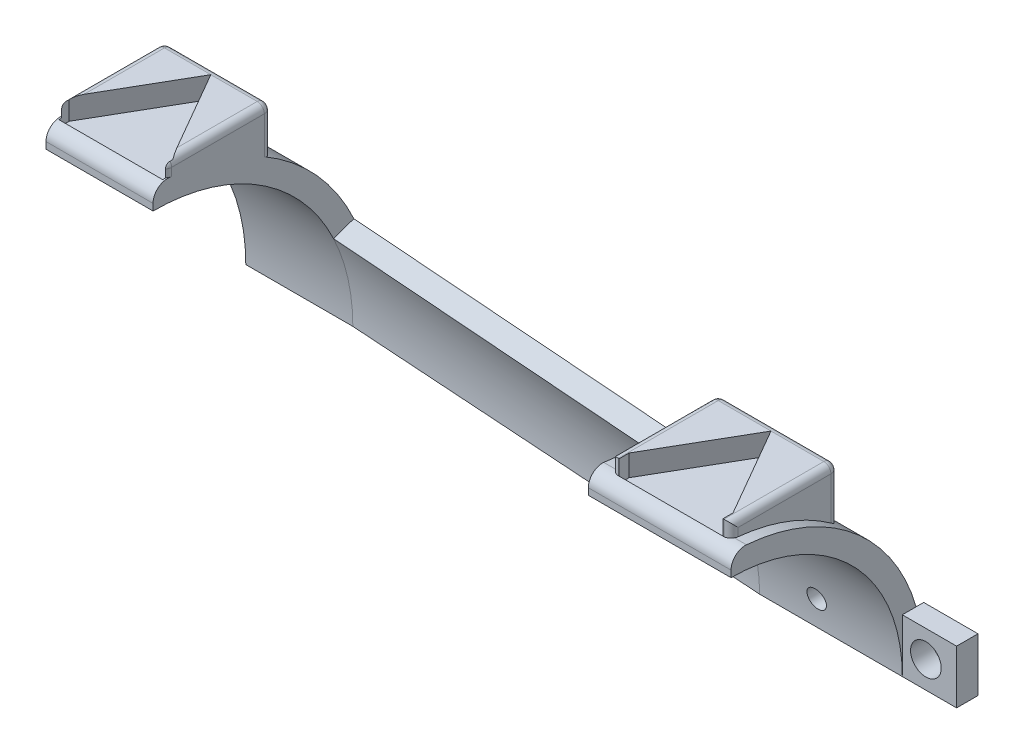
ISO-10303-21;
HEADER;
FILE_DESCRIPTION(('STEP AP214'),'2;1');
FILE_NAME('part.step','',(''),(''),'','','');
FILE_SCHEMA(('AUTOMOTIVE_DESIGN { 1 0 10303 214 1 1 1 1 }'));
ENDSEC;
DATA;
#1=APPLICATION_CONTEXT('core data for automotive mechanical design processes');
#2=APPLICATION_PROTOCOL_DEFINITION('international standard','automotive_design',2000,#1);
#3=PRODUCT_CONTEXT('',#1,'mechanical');
#4=PRODUCT('Part','Part','',(#3));
#5=PRODUCT_RELATED_PRODUCT_CATEGORY('part','',(#4));
#6=PRODUCT_DEFINITION_FORMATION('','',#4);
#7=PRODUCT_DEFINITION_CONTEXT('part definition',#1,'design');
#8=PRODUCT_DEFINITION('design','',#6,#7);
#9=PRODUCT_DEFINITION_SHAPE('','',#8);
#10=(LENGTH_UNIT() NAMED_UNIT(*) SI_UNIT(.MILLI.,.METRE.));
#11=(NAMED_UNIT(*) PLANE_ANGLE_UNIT() SI_UNIT($,.RADIAN.));
#12=(NAMED_UNIT(*) SI_UNIT($,.STERADIAN.) SOLID_ANGLE_UNIT());
#13=UNCERTAINTY_MEASURE_WITH_UNIT(LENGTH_MEASURE(1.E-05),#10,'distance_accuracy_value','');
#14=(GEOMETRIC_REPRESENTATION_CONTEXT(3) GLOBAL_UNCERTAINTY_ASSIGNED_CONTEXT((#13)) GLOBAL_UNIT_ASSIGNED_CONTEXT((#10,
#11,#12)) REPRESENTATION_CONTEXT('',''));
#15=CARTESIAN_POINT('',(0.,0.,0.));
#16=DIRECTION('',(0.,0.,1.));
#17=DIRECTION('',(1.,0.,0.));
#18=AXIS2_PLACEMENT_3D('',#15,#16,#17);
#19=CARTESIAN_POINT('',(19.05,0.,63.5));
#20=DIRECTION('',(-1.,0.,0.));
#21=DIRECTION('',(0.,0.,-1.));
#22=AXIS2_PLACEMENT_3D('',#19,#20,#21);
#23=CYLINDRICAL_SURFACE('',#22,39.37);
#24=CARTESIAN_POINT('',(19.05,0.,63.5));
#25=DIRECTION('',(-1.,0.,0.));
#26=DIRECTION('',(0.,0.,1.));
#27=AXIS2_PLACEMENT_3D('',#24,#25,#26);
#28=CIRCLE('',#27,39.37);
#29=CARTESIAN_POINT('',(19.05,39.2762617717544,60.7848275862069));
#30=VERTEX_POINT('',#29);
#31=CARTESIAN_POINT('',(19.05,39.2312846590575,60.198));
#32=VERTEX_POINT('',#31);
#33=EDGE_CURVE('E907',#30,#32,#28,.T.);
#34=ORIENTED_EDGE('',*,*,#33,.T.);
#35=CARTESIAN_POINT('',(17.78,39.3175263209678,61.468));
#36=CARTESIAN_POINT('',(17.815689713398,39.3175260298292,61.4679997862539));
#37=CARTESIAN_POINT('',(17.8513623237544,39.3174485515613,61.4664946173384));
#38=CARTESIAN_POINT('',(17.9224521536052,39.317137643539,61.4604900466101));
#39=CARTESIAN_POINT('',(17.9578693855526,39.3169042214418,61.4559907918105));
#40=CARTESIAN_POINT('',(18.0632939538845,39.3159687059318,61.4380452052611));
#41=CARTESIAN_POINT('',(18.1325949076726,39.3150313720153,61.4201509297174));
#42=CARTESIAN_POINT('',(18.2672025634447,39.3125085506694,61.3730015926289));
#43=CARTESIAN_POINT('',(18.3325073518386,39.3109227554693,61.3437411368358));
#44=CARTESIAN_POINT('',(18.457270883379,39.3070748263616,61.2747001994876));
#45=CARTESIAN_POINT('',(18.5167306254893,39.3048128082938,61.2349215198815));
#46=CARTESIAN_POINT('',(18.6281398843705,39.2995853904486,61.1459677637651));
#47=CARTESIAN_POINT('',(18.6800870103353,39.2966197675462,61.0967897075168));
#48=CARTESIAN_POINT('',(18.7749964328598,39.289971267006,60.9904402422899));
#49=CARTESIAN_POINT('',(18.8179570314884,39.2862882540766,60.9332673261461));
#50=CARTESIAN_POINT('',(18.8937289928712,39.2782110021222,60.8124908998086));
#51=CARTESIAN_POINT('',(18.9265259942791,39.273815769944,60.7488784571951));
#52=CARTESIAN_POINT('',(18.9809669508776,39.2643629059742,60.6171096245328));
#53=CARTESIAN_POINT('',(19.0026168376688,39.2593056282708,60.5489556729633));
#54=CARTESIAN_POINT('',(19.0289060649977,39.2504091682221,60.4333354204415));
#55=CARTESIAN_POINT('',(19.0368128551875,39.2467282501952,60.3865732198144));
#56=CARTESIAN_POINT('',(19.0473591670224,39.2391561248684,60.2925444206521));
#57=CARTESIAN_POINT('',(19.0500062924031,39.2352652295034,60.2452786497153));
#58=CARTESIAN_POINT('',(19.05,39.2312846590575,60.198));
#59=B_SPLINE_CURVE_WITH_KNOTS('',3,(#35,#36,#37,#38,#39,#40,#41,#42,#43,#44,#45,#46,#47,#48,#49,
#50,#51,#52,#53,#54,#55,#56,#57,#58),.UNSPECIFIED.,.F.,.F.,(4,2,2,2,2,2,2,2,2,2,2,4),(0.,
0.107003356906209,0.214001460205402,0.427640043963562,0.641380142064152,0.8550836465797,
1.06885501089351,1.28266672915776,1.49677920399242,1.71077762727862,1.85320769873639,
1.9954317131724),.UNSPECIFIED.);
#60=CARTESIAN_POINT('',(18.9062918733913,39.2762617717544,60.7848275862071));
#61=VERTEX_POINT('',#60);
#62=EDGE_CURVE('E802',#61,#32,#59,.T.);
#63=ORIENTED_EDGE('',*,*,#62,.F.);
#64=DIRECTION('',(-1.,0.,0.));
#65=VECTOR('',#64,1.);
#66=CARTESIAN_POINT('',(19.05,39.2762617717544,60.7848275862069));
#67=LINE('',#66,#65);
#68=EDGE_CURVE('E989',#30,#61,#67,.T.);
#69=ORIENTED_EDGE('',*,*,#68,.F.);
#70=EDGE_LOOP('',(#34,#63,#69));
#71=FACE_BOUND('',#70,.T.);
#72=ADVANCED_FACE('F121',(#71),#23,.T.);
#73=CARTESIAN_POINT('',(0.,41.91,63.5));
#74=DIRECTION('',(0.,-1.,0.));
#75=DIRECTION('',(0.,0.,1.));
#76=AXIS2_PLACEMENT_3D('',#73,#74,#75);
#77=PLANE('',#76);
#78=DIRECTION('',(1.,0.,0.));
#79=VECTOR('',#78,1.);
#80=CARTESIAN_POINT('',(19.05,41.91,43.688));
#81=LINE('',#80,#79);
#82=CARTESIAN_POINT('',(1.27,41.91,43.688));
#83=VERTEX_POINT('',#82);
#84=CARTESIAN_POINT('',(9.525,41.91,43.688));
#85=VERTEX_POINT('',#84);
#86=EDGE_CURVE('E1070',#83,#85,#81,.T.);
#87=ORIENTED_EDGE('',*,*,#86,.F.);
#88=DIRECTION('',(0.,0.,-1.));
#89=VECTOR('',#88,1.);
#90=CARTESIAN_POINT('',(1.27,41.91,63.5));
#91=LINE('',#90,#89);
#92=CARTESIAN_POINT('',(1.27,41.91,57.9860794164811));
#93=VERTEX_POINT('',#92);
#94=EDGE_CURVE('E1061',#93,#83,#91,.T.);
#95=ORIENTED_EDGE('',*,*,#94,.F.);
#96=DIRECTION('',(0.500000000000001,0.,-0.866025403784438));
#97=VECTOR('',#96,1.);
#98=CARTESIAN_POINT('',(0.286240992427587,41.91,59.69));
#99=LINE('',#98,#97);
#100=EDGE_CURVE('E505',#93,#85,#99,.T.);
#101=ORIENTED_EDGE('',*,*,#100,.T.);
#102=EDGE_LOOP('',(#87,#95,#101));
#103=FACE_BOUND('',#102,.T.);
#104=ADVANCED_FACE('F859',(#103),#77,.F.);
#105=CARTESIAN_POINT('',(0.,36.83,63.5));
#106=DIRECTION('',(0.,-1.,0.));
#107=DIRECTION('',(0.,0.,1.));
#108=AXIS2_PLACEMENT_3D('',#105,#106,#107);
#109=PLANE('',#108);
#110=DIRECTION('',(1.,0.,0.));
#111=VECTOR('',#110,1.);
#112=CARTESIAN_POINT('',(119.888,36.83,43.688));
#113=LINE('',#112,#111);
#114=CARTESIAN_POINT('',(109.22,36.83,43.688));
#115=VERTEX_POINT('',#114);
#116=CARTESIAN_POINT('',(118.618,36.83,43.688));
#117=VERTEX_POINT('',#116);
#118=EDGE_CURVE('E1101',#115,#117,#113,.T.);
#119=ORIENTED_EDGE('',*,*,#118,.F.);
#120=DIRECTION('',(0.500000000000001,0.,0.866025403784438));
#121=VECTOR('',#120,1.);
#122=CARTESIAN_POINT('',(109.22,36.83,43.688));
#123=LINE('',#122,#121);
#124=CARTESIAN_POINT('',(118.458759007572,36.83,59.69));
#125=VERTEX_POINT('',#124);
#126=EDGE_CURVE('E559',#115,#125,#123,.T.);
#127=ORIENTED_EDGE('',*,*,#126,.T.);
#128=DIRECTION('',(0.,0.,1.));
#129=VECTOR('',#128,1.);
#130=CARTESIAN_POINT('',(118.458759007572,36.83,61.468));
#131=LINE('',#130,#129);
#132=CARTESIAN_POINT('',(118.458759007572,36.83,61.468));
#133=VERTEX_POINT('',#132);
#134=EDGE_CURVE('E562',#125,#133,#131,.T.);
#135=ORIENTED_EDGE('',*,*,#134,.T.);
#136=DIRECTION('',(1.,0.,0.));
#137=VECTOR('',#136,1.);
#138=CARTESIAN_POINT('',(98.552,36.83,61.468));
#139=LINE('',#138,#137);
#140=CARTESIAN_POINT('',(118.618,36.83,61.468));
#141=VERTEX_POINT('',#140);
#142=EDGE_CURVE('E569',#133,#141,#139,.T.);
#143=ORIENTED_EDGE('',*,*,#142,.T.);
#144=DIRECTION('',(0.,0.,-1.));
#145=VECTOR('',#144,1.);
#146=CARTESIAN_POINT('',(118.618,36.83,63.5));
#147=LINE('',#146,#145);
#148=EDGE_CURVE('E1047',#117,#141,#147,.F.);
#149=ORIENTED_EDGE('',*,*,#148,.F.);
#150=EDGE_LOOP('',(#119,#127,#135,#143,#149));
#151=FACE_BOUND('',#150,.T.);
#152=ADVANCED_FACE('F864',(#151),#109,.F.);
#153=CARTESIAN_POINT('',(0.,39.2312846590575,60.198));
#154=CARTESIAN_POINT('',(2.95019256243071E-07,39.234293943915,60.2337502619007));
#155=CARTESIAN_POINT('',(0.00151049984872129,39.237252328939,60.2694877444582));
#156=CARTESIAN_POINT('',(0.00753780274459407,39.243051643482,60.3407166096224));
#157=CARTESIAN_POINT('',(0.0120548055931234,39.2458925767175,60.3762079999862));
#158=CARTESIAN_POINT('',(0.0300782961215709,39.2542074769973,60.4818773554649));
#159=CARTESIAN_POINT('',(0.048057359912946,39.2594828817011,60.5513616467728));
#160=CARTESIAN_POINT('',(0.0954656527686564,39.2693893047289,60.6863616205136));
#161=CARTESIAN_POINT('',(0.124901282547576,39.2740199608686,60.7518750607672));
#162=CARTESIAN_POINT('',(0.194398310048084,39.2825780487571,60.8770441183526));
#163=CARTESIAN_POINT('',(0.234457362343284,39.2865056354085,60.9367010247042));
#164=CARTESIAN_POINT('',(0.32397285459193,39.2936290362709,61.0483179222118));
#165=CARTESIAN_POINT('',(0.373408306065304,39.2968264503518,61.1002946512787));
#166=CARTESIAN_POINT('',(0.480348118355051,39.3025086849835,61.1952270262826));
#167=CARTESIAN_POINT('',(0.537854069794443,39.3049933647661,61.238180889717));
#168=CARTESIAN_POINT('',(0.659167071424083,39.3092688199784,61.3137429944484));
#169=CARTESIAN_POINT('',(0.722962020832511,39.3110608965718,61.3463706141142));
#170=CARTESIAN_POINT('',(0.855123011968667,39.3139859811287,61.4004419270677));
#171=CARTESIAN_POINT('',(0.92348625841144,39.3151193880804,61.4218923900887));
#172=CARTESIAN_POINT('',(1.03856466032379,39.3164682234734,61.4476040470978));
#173=CARTESIAN_POINT('',(1.08455031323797,39.3168657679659,61.4552479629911));
#174=CARTESIAN_POINT('',(1.17701749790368,39.3173942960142,61.4654451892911));
#175=CARTESIAN_POINT('',(1.22349822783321,39.3175256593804,61.4680057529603));
#176=CARTESIAN_POINT('',(1.27,39.3175263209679,61.468));
#177=B_SPLINE_CURVE_WITH_KNOTS('',3,(#153,#154,#155,#156,#157,#158,#159,#160,#161,#162,#163,
#164,#165,#166,#167,#168,#169,#170,#171,#172,#173,#174,#175,#176),.UNSPECIFIED.,.F.,.F.,(4,2,2,
2,2,2,2,2,2,2,2,4),(0.,0.107564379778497,0.215125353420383,0.429916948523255,0.644828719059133,
0.859693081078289,1.07408204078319,1.28851331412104,1.5025397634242,1.7164364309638,
1.85602944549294,1.99542313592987),.UNSPECIFIED.);
#178=CARTESIAN_POINT('',(0.,39.2312846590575,60.198));
#179=VERTEX_POINT('',#178);
#180=CARTESIAN_POINT('',(0.143708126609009,39.2762617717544,60.7848275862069));
#181=VERTEX_POINT('',#180);
#182=EDGE_CURVE('E810',#179,#181,#177,.T.);
#183=ORIENTED_EDGE('',*,*,#182,.F.);
#184=CARTESIAN_POINT('',(0.,0.,63.5));
#185=DIRECTION('',(-1.,0.,0.));
#186=DIRECTION('',(0.,0.,1.));
#187=AXIS2_PLACEMENT_3D('',#184,#185,#186);
#188=CIRCLE('',#187,39.37);
#189=CARTESIAN_POINT('',(0.,39.2762617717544,60.7848275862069));
#190=VERTEX_POINT('',#189);
#191=EDGE_CURVE('E886',#190,#179,#188,.T.);
#192=ORIENTED_EDGE('',*,*,#191,.F.);
#193=DIRECTION('',(-1.,0.,0.));
#194=VECTOR('',#193,1.);
#195=CARTESIAN_POINT('',(19.05,39.2762617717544,60.7848275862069));
#196=LINE('',#195,#194);
#197=EDGE_CURVE('E888',#181,#190,#196,.T.);
#198=ORIENTED_EDGE('',*,*,#197,.F.);
#199=EDGE_LOOP('',(#183,#192,#198));
#200=FACE_BOUND('',#199,.T.);
#201=ADVANCED_FACE('F827',(#200),#23,.T.);
#202=CARTESIAN_POINT('',(98.552,-0.00310000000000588,61.468));
#203=DIRECTION('',(0.,0.,-1.));
#204=DIRECTION('',(1.,0.,0.));
#205=AXIS2_PLACEMENT_3D('',#202,#203,#204);
#206=PLANE('',#205);
#207=DIRECTION('',(0.,-1.,0.));
#208=VECTOR('',#207,1.);
#209=CARTESIAN_POINT('',(99.9812409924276,-0.00310000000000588,61.468));
#210=LINE('',#209,#208);
#211=CARTESIAN_POINT('',(99.9812409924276,36.83,61.468));
#212=VERTEX_POINT('',#211);
#213=CARTESIAN_POINT('',(99.9812409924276,34.1369184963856,61.468));
#214=VERTEX_POINT('',#213);
#215=EDGE_CURVE('E1054',#212,#214,#210,.T.);
#216=ORIENTED_EDGE('',*,*,#215,.F.);
#217=CARTESIAN_POINT('',(99.822,36.83,61.468));
#218=VERTEX_POINT('',#217);
#219=EDGE_CURVE('E587',#218,#212,#139,.T.);
#220=ORIENTED_EDGE('',*,*,#219,.F.);
#221=DIRECTION('',(0.,1.,0.));
#222=VECTOR('',#221,1.);
#223=CARTESIAN_POINT('',(99.822,36.83,61.468));
#224=LINE('',#223,#222);
#225=CARTESIAN_POINT('',(99.822,34.1369184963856,61.468));
#226=VERTEX_POINT('',#225);
#227=EDGE_CURVE('E1050',#226,#218,#224,.T.);
#228=ORIENTED_EDGE('',*,*,#227,.F.);
#229=DIRECTION('',(-1.,0.,0.));
#230=VECTOR('',#229,1.);
#231=CARTESIAN_POINT('',(99.9812409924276,34.1369184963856,61.468));
#232=LINE('',#231,#230);
#233=EDGE_CURVE('E783',#214,#226,#232,.T.);
#234=ORIENTED_EDGE('',*,*,#233,.F.);
#235=EDGE_LOOP('',(#216,#220,#228,#234));
#236=FACE_BOUND('',#235,.T.);
#237=ADVANCED_FACE('F736',(#236),#206,.F.);
#238=CARTESIAN_POINT('',(121.92,0.,63.5));
#239=DIRECTION('',(-1.,0.,0.));
#240=DIRECTION('',(0.,0.,-1.));
#241=AXIS2_PLACEMENT_3D('',#238,#239,#240);
#242=CYLINDRICAL_SURFACE('',#241,34.29);
#243=CARTESIAN_POINT('',(121.92,0.,63.5));
#244=DIRECTION('',(-1.,0.,0.));
#245=DIRECTION('',(0.,0.,1.));
#246=AXIS2_PLACEMENT_3D('',#243,#244,#245);
#247=CIRCLE('',#246,34.29);
#248=CARTESIAN_POINT('',(121.92,34.1800958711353,60.7568));
#249=VERTEX_POINT('',#248);
#250=CARTESIAN_POINT('',(121.92,9.525,30.559470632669));
#251=VERTEX_POINT('',#250);
#252=EDGE_CURVE('E1185',#249,#251,#247,.T.);
#253=ORIENTED_EDGE('',*,*,#252,.T.);
#254=CARTESIAN_POINT('',(121.92,0.,63.5));
#255=DIRECTION('',(1.,0.,0.));
#256=DIRECTION('',(0.,0.,-1.));
#257=AXIS2_PLACEMENT_3D('',#254,#255,#256);
#258=CIRCLE('',#257,34.29);
#259=CARTESIAN_POINT('',(121.92,0.,29.21));
#260=VERTEX_POINT('',#259);
#261=EDGE_CURVE('E1250',#260,#251,#258,.T.);
#262=ORIENTED_EDGE('',*,*,#261,.F.);
#263=DIRECTION('',(-1.,0.,0.));
#264=VECTOR('',#263,1.);
#265=CARTESIAN_POINT('',(121.92,0.,29.21));
#266=LINE('',#265,#264);
#267=CARTESIAN_POINT('',(111.262234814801,0.,29.21));
#268=VERTEX_POINT('',#267);
#269=EDGE_CURVE('E1204',#260,#268,#266,.T.);
#270=ORIENTED_EDGE('',*,*,#269,.T.);
#271=CARTESIAN_POINT('',(111.262234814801,0.,63.5));
#272=DIRECTION('',(1.,0.,0.));
#273=DIRECTION('',(0.,0.,-1.));
#274=AXIS2_PLACEMENT_3D('',#271,#272,#273);
#275=CIRCLE('',#274,34.29);
#276=CARTESIAN_POINT('',(111.262234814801,9.525,30.559470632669));
#277=VERTEX_POINT('',#276);
#278=EDGE_CURVE('E1259',#268,#277,#275,.T.);
#279=ORIENTED_EDGE('',*,*,#278,.T.);
#280=DIRECTION('',(-1.,0.,0.));
#281=VECTOR('',#280,1.);
#282=CARTESIAN_POINT('',(121.92,9.525,30.559470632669));
#283=LINE('',#282,#281);
#284=CARTESIAN_POINT('',(102.87,9.525,30.559470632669));
#285=VERTEX_POINT('',#284);
#286=EDGE_CURVE('E976',#277,#285,#283,.T.);
#287=ORIENTED_EDGE('',*,*,#286,.T.);
#288=CARTESIAN_POINT('',(102.87,0.,63.5));
#289=DIRECTION('',(-1.,0.,0.));
#290=DIRECTION('',(0.,0.,1.));
#291=AXIS2_PLACEMENT_3D('',#288,#289,#290);
#292=CIRCLE('',#291,34.29);
#293=CARTESIAN_POINT('',(102.87,0.,29.21));
#294=VERTEX_POINT('',#293);
#295=EDGE_CURVE('E1264',#285,#294,#292,.T.);
#296=ORIENTED_EDGE('',*,*,#295,.T.);
#297=CARTESIAN_POINT('',(96.52,0.,29.21));
#298=VERTEX_POINT('',#297);
#299=EDGE_CURVE('E1200',#294,#298,#266,.T.);
#300=ORIENTED_EDGE('',*,*,#299,.T.);
#301=CARTESIAN_POINT('',(96.52,0.,63.5));
#302=DIRECTION('',(-1.,0.,0.));
#303=DIRECTION('',(0.,0.,1.));
#304=AXIS2_PLACEMENT_3D('',#301,#302,#303);
#305=CIRCLE('',#304,34.29);
#306=CARTESIAN_POINT('',(96.52,16.51,33.446314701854));
#307=VERTEX_POINT('',#306);
#308=EDGE_CURVE('E1215',#307,#298,#305,.T.);
#309=ORIENTED_EDGE('',*,*,#308,.F.);
#310=CARTESIAN_POINT('',(96.52,0.,63.5));
#311=DIRECTION('',(-1.,0.,0.));
#312=DIRECTION('',(0.,0.,1.));
#313=AXIS2_PLACEMENT_3D('',#310,#311,#312);
#314=CIRCLE('',#313,34.29);
#315=CARTESIAN_POINT('',(96.52,34.1800958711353,60.7568));
#316=VERTEX_POINT('',#315);
#317=EDGE_CURVE('E1181',#316,#307,#314,.T.);
#318=ORIENTED_EDGE('',*,*,#317,.F.);
#319=DIRECTION('',(-1.,0.,0.));
#320=VECTOR('',#319,1.);
#321=CARTESIAN_POINT('',(121.92,34.1800958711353,60.7568));
#322=LINE('',#321,#320);
#323=CARTESIAN_POINT('',(98.6815428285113,34.1800958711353,60.7568));
#324=VERTEX_POINT('',#323);
#325=EDGE_CURVE('E1180',#324,#316,#322,.T.);
#326=ORIENTED_EDGE('',*,*,#325,.F.);
#327=CARTESIAN_POINT('',(98.552,34.1306445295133,60.198));
#328=CARTESIAN_POINT('',(98.5520003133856,34.1341041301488,60.2337564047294));
#329=CARTESIAN_POINT('',(98.5535110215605,34.1375052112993,60.2695014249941));
#330=CARTESIAN_POINT('',(98.5595411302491,34.1441723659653,60.3407484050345));
#331=CARTESIAN_POINT('',(98.5640604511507,34.1474384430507,60.3762503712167));
#332=CARTESIAN_POINT('',(98.5820952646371,34.1569979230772,60.481958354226));
#333=CARTESIAN_POINT('',(98.600087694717,34.1630630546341,60.5514749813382));
#334=CARTESIAN_POINT('',(98.6475410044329,34.1744525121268,60.6865491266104));
#335=CARTESIAN_POINT('',(98.6770085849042,34.1797764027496,60.752104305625));
#336=CARTESIAN_POINT('',(98.7465914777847,34.1896151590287,60.877355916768));
#337=CARTESIAN_POINT('',(98.7867042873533,34.194130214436,60.9370537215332));
#338=CARTESIAN_POINT('',(98.8763180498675,34.2023153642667,61.0487033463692));
#339=CARTESIAN_POINT('',(98.9257912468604,34.2059878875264,61.1006772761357));
#340=CARTESIAN_POINT('',(99.0328159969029,34.2125138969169,61.1955993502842));
#341=CARTESIAN_POINT('',(99.0903691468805,34.2153672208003,61.2385457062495));
#342=CARTESIAN_POINT('',(99.2117427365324,34.220274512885,61.3140572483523));
#343=CARTESIAN_POINT('',(99.275546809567,34.2223305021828,61.3466486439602));
#344=CARTESIAN_POINT('',(99.4077234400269,34.2256856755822,61.4006485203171));
#345=CARTESIAN_POINT('',(99.4760931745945,34.2269853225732,61.4220638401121));
#346=CARTESIAN_POINT('',(99.591078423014,34.2285297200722,61.4476951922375));
#347=CARTESIAN_POINT('',(99.6369632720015,34.2289843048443,61.4553049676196));
#348=CARTESIAN_POINT('',(99.7292255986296,34.2295886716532,61.4654566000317));
#349=CARTESIAN_POINT('',(99.7756022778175,34.229738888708,61.4680056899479));
#350=CARTESIAN_POINT('',(99.822,34.2297396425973,61.468));
#351=B_SPLINE_CURVE_WITH_KNOTS('',3,(#327,#328,#329,#330,#331,#332,#333,#334,#335,#336,#337,
#338,#339,#340,#341,#342,#343,#344,#345,#346,#347,#348,#349,#350),.UNSPECIFIED.,.F.,.F.,(4,2,2,
2,2,2,2,2,2,2,2,4),(0.,0.107704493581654,0.215406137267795,0.430486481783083,0.64569260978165,
0.860848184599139,1.07537549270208,1.28994525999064,1.50396752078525,1.71785865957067,
1.85713981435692,1.99622176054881),.UNSPECIFIED.);
#352=CARTESIAN_POINT('',(98.552,34.1306445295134,60.198));
#353=VERTEX_POINT('',#352);
#354=EDGE_CURVE('E757',#353,#324,#351,.T.);
#355=ORIENTED_EDGE('',*,*,#354,.F.);
#356=CARTESIAN_POINT('',(98.552,0.,63.5));
#357=DIRECTION('',(1.,0.,0.));
#358=DIRECTION('',(0.,0.,-1.));
#359=AXIS2_PLACEMENT_3D('',#356,#357,#358);
#360=CIRCLE('',#359,34.29);
#361=CARTESIAN_POINT('',(98.552,27.9872963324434,43.688));
#362=VERTEX_POINT('',#361);
#363=EDGE_CURVE('E583',#353,#362,#360,.F.);
#364=ORIENTED_EDGE('',*,*,#363,.T.);
#365=CARTESIAN_POINT('',(99.822,27.0435459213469,42.418));
#366=CARTESIAN_POINT('',(99.7914856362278,27.0435432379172,42.417997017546));
#367=CARTESIAN_POINT('',(99.7609885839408,27.0444039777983,42.4191006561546));
#368=CARTESIAN_POINT('',(99.7002630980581,27.047818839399,42.4234820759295));
#369=CARTESIAN_POINT('',(99.6700345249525,27.0503720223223,42.4267586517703));
#370=CARTESIAN_POINT('',(99.5804841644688,27.0604727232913,42.4397283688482));
#371=CARTESIAN_POINT('',(99.5218513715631,27.0704624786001,42.4525627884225));
#372=CARTESIAN_POINT('',(99.4083276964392,27.0962740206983,42.4858031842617));
#373=CARTESIAN_POINT('',(99.35343013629,27.1120850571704,42.5061952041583));
#374=CARTESIAN_POINT('',(99.2482447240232,27.1486670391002,42.5535236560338));
#375=CARTESIAN_POINT('',(99.1979638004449,27.1694452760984,42.5804697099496));
#376=CARTESIAN_POINT('',(99.0990510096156,27.2167933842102,42.6421027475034));
#377=CARTESIAN_POINT('',(99.0508508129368,27.2436878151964,42.6772285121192));
#378=CARTESIAN_POINT('',(98.9610464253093,27.3010804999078,42.7525339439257));
#379=CARTESIAN_POINT('',(98.9194436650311,27.3315795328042,42.7927147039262));
#380=CARTESIAN_POINT('',(98.8351549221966,27.401780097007,42.8856704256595));
#381=CARTESIAN_POINT('',(98.7939698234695,27.4420916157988,42.9393446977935));
#382=CARTESIAN_POINT('',(98.7212703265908,27.5254107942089,43.0510213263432));
#383=CARTESIAN_POINT('',(98.6897674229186,27.5684215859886,43.1090287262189));
#384=CARTESIAN_POINT('',(98.6310812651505,27.6648339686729,43.239967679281));
#385=CARTESIAN_POINT('',(98.6060013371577,27.7186015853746,43.3135738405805));
#386=CARTESIAN_POINT('',(98.5696640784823,27.8270407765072,43.4633231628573));
#387=CARTESIAN_POINT('',(98.5583867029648,27.881710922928,43.539462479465));
#388=CARTESIAN_POINT('',(98.5526813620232,27.9532593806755,43.6399829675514));
#389=CARTESIAN_POINT('',(98.5520003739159,27.9702967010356,43.6639846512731));
#390=CARTESIAN_POINT('',(98.552,27.9872963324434,43.688));
#391=B_SPLINE_CURVE_WITH_KNOTS('',3,(#365,#366,#367,#368,#369,#370,#371,#372,#373,#374,#375,
#376,#377,#378,#379,#380,#381,#382,#383,#384,#385,#386,#387,#388,#389,#390),.UNSPECIFIED.,.F.,
.F.,(4,2,2,2,2,2,2,2,2,2,2,2,4),(0.,0.0914778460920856,0.182904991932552,0.364439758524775,
0.545640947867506,0.7271097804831,0.922678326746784,1.11828922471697,1.35368787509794,
1.58936491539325,1.87188811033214,2.15400052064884,2.24229137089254),.UNSPECIFIED.);
#392=CARTESIAN_POINT('',(99.822,27.0435459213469,42.418));
#393=VERTEX_POINT('',#392);
#394=EDGE_CURVE('E762',#393,#362,#391,.T.);
#395=ORIENTED_EDGE('',*,*,#394,.F.);
#396=DIRECTION('',(-1.,0.,0.));
#397=VECTOR('',#396,1.);
#398=CARTESIAN_POINT('',(121.92,27.0435459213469,42.418));
#399=LINE('',#398,#397);
#400=CARTESIAN_POINT('',(118.618,27.0435459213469,42.418));
#401=VERTEX_POINT('',#400);
#402=EDGE_CURVE('E579',#393,#401,#399,.F.);
#403=ORIENTED_EDGE('',*,*,#402,.T.);
#404=CARTESIAN_POINT('',(119.888,27.9872963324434,43.688));
#405=CARTESIAN_POINT('',(119.887992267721,27.9562658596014,43.6441639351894));
#406=CARTESIAN_POINT('',(119.885729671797,27.9251483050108,43.6004257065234));
#407=CARTESIAN_POINT('',(119.87670232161,27.8629201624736,43.5133885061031));
#408=CARTESIAN_POINT('',(119.869936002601,27.8318095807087,43.4700896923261));
#409=CARTESIAN_POINT('',(119.84274175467,27.7382649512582,43.3405327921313));
#410=CARTESIAN_POINT('',(119.815418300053,27.676152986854,43.2553696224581));
#411=CARTESIAN_POINT('',(119.743030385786,27.5559916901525,43.0921200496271));
#412=CARTESIAN_POINT('',(119.698244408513,27.4978946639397,43.0139451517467));
#413=CARTESIAN_POINT('',(119.59084527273,27.3874930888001,42.866587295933));
#414=CARTESIAN_POINT('',(119.528315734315,27.3351629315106,42.7973643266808));
#415=CARTESIAN_POINT('',(119.410134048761,27.2560090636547,42.693347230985));
#416=CARTESIAN_POINT('',(119.359437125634,27.2265810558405,42.6548727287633));
#417=CARTESIAN_POINT('',(119.250802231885,27.1729378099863,42.5849938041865));
#418=CARTESIAN_POINT('',(119.192864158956,27.1487226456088,42.5535894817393));
#419=CARTESIAN_POINT('',(119.070173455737,27.106758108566,42.4993103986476));
#420=CARTESIAN_POINT('',(119.005361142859,27.0890725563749,42.4765197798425));
#421=CARTESIAN_POINT('',(118.871348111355,27.0619494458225,42.4416169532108));
#422=CARTESIAN_POINT('',(118.80216107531,27.0524874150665,42.4294730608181));
#423=CARTESIAN_POINT('',(118.71328877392,27.0462228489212,42.4214343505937));
#424=CARTESIAN_POINT('',(118.69425665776,27.0452194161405,42.4201469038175));
#425=CARTESIAN_POINT('',(118.656153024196,27.0438820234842,42.4184310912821));
#426=CARTESIAN_POINT('',(118.637081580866,27.043547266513,42.4180017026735));
#427=CARTESIAN_POINT('',(118.618,27.0435459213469,42.418));
#428=B_SPLINE_CURVE_WITH_KNOTS('',3,(#404,#405,#406,#407,#408,#409,#410,#411,#412,#413,#414,
#415,#416,#417,#418,#419,#420,#421,#422,#423,#424,#425,#426,#427),.UNSPECIFIED.,.F.,.F.,(4,2,2,
2,2,2,2,2,2,2,2,4),(0.,0.161016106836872,0.322088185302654,0.646974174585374,0.966878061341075,
1.28529868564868,1.49487636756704,1.7044570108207,1.91603502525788,2.12698122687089,
2.18426635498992,2.24148315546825),.UNSPECIFIED.);
#429=CARTESIAN_POINT('',(119.888,27.9872963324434,43.688));
#430=VERTEX_POINT('',#429);
#431=EDGE_CURVE('E742',#430,#401,#428,.T.);
#432=ORIENTED_EDGE('',*,*,#431,.F.);
#433=CARTESIAN_POINT('',(119.888,0.,63.5));
#434=DIRECTION('',(1.,0.,0.));
#435=DIRECTION('',(0.,0.,-1.));
#436=AXIS2_PLACEMENT_3D('',#433,#434,#435);
#437=CIRCLE('',#436,34.29);
#438=CARTESIAN_POINT('',(119.888,34.1306445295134,60.198));
#439=VERTEX_POINT('',#438);
#440=EDGE_CURVE('E582',#439,#430,#437,.F.);
#441=ORIENTED_EDGE('',*,*,#440,.F.);
#442=CARTESIAN_POINT('',(118.618,34.2297396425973,61.468));
#443=CARTESIAN_POINT('',(118.653676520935,34.2297393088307,61.4679997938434));
#444=CARTESIAN_POINT('',(118.689335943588,34.229650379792,61.4664957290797));
#445=CARTESIAN_POINT('',(118.760399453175,34.229293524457,61.4604956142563));
#446=CARTESIAN_POINT('',(118.795803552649,34.2290256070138,61.4559997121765));
#447=CARTESIAN_POINT('',(118.901188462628,34.2279518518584,61.4380677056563));
#448=CARTESIAN_POINT('',(118.97046309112,34.2268760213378,61.4201871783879));
#449=CARTESIAN_POINT('',(119.105019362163,34.2239805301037,61.3730756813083));
#450=CARTESIAN_POINT('',(119.1702990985,34.2221605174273,61.3438393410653));
#451=CARTESIAN_POINT('',(119.295015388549,34.2177444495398,61.2748585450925));
#452=CARTESIAN_POINT('',(119.354452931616,34.2151485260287,61.235115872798));
#453=CARTESIAN_POINT('',(119.465828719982,34.2091494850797,61.1462434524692));
#454=CARTESIAN_POINT('',(119.51776379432,34.2057460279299,61.0971097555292));
#455=CARTESIAN_POINT('',(119.612655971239,34.1981163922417,60.9908635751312));
#456=CARTESIAN_POINT('',(119.655611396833,34.1938900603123,60.9337496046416));
#457=CARTESIAN_POINT('',(119.7313999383,34.1846200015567,60.8130835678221));
#458=CARTESIAN_POINT('',(119.764214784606,34.1795748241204,60.7495201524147));
#459=CARTESIAN_POINT('',(119.818702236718,34.1687243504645,60.6178605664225));
#460=CARTESIAN_POINT('',(119.840380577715,34.1629194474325,60.5497667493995));
#461=CARTESIAN_POINT('',(119.866774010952,34.1526912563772,60.4340664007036));
#462=CARTESIAN_POINT('',(119.874730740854,34.1484484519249,60.3871570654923));
#463=CARTESIAN_POINT('',(119.885343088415,34.139719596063,60.2928346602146));
#464=CARTESIAN_POINT('',(119.888006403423,34.1352339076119,60.2454224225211));
#465=CARTESIAN_POINT('',(119.888,34.1306445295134,60.198));
#466=B_SPLINE_CURVE_WITH_KNOTS('',3,(#442,#443,#444,#445,#446,#447,#448,#449,#450,#451,#452,
#453,#454,#455,#456,#457,#458,#459,#460,#461,#462,#463,#464,#465),.UNSPECIFIED.,.F.,.F.,(4,2,2,
2,2,2,2,2,2,2,2,4),(0.,0.106963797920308,0.21392230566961,0.427480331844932,0.641139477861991,
0.85476237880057,1.06847530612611,1.28222810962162,1.49636380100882,1.71038910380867,
1.85341515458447,1.99623307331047),.UNSPECIFIED.);
#467=CARTESIAN_POINT('',(119.758457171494,34.1800958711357,60.7568000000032));
#468=VERTEX_POINT('',#467);
#469=EDGE_CURVE('E751',#468,#439,#466,.T.);
#470=ORIENTED_EDGE('',*,*,#469,.F.);
#471=DIRECTION('',(-1.,0.,0.));
#472=VECTOR('',#471,1.);
#473=CARTESIAN_POINT('',(121.92,34.1800958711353,60.7568));
#474=LINE('',#473,#472);
#475=EDGE_CURVE('E1133',#249,#468,#474,.T.);
#476=ORIENTED_EDGE('',*,*,#475,.F.);
#477=EDGE_LOOP('',(#253,#262,#270,#279,#287,#296,#300,#309,#318,#326,#355,#364,#395,#403,#432,
#441,#470,#476));
#478=FACE_BOUND('',#477,.T.);
#479=ADVANCED_FACE('F727',(#478),#242,.T.);
#480=CARTESIAN_POINT('',(121.92,0.,63.5));
#481=DIRECTION('',(1.,0.,0.));
#482=DIRECTION('',(0.,0.,1.));
#483=AXIS2_PLACEMENT_3D('',#480,#481,#482);
#484=PLANE('',#483);
#485=DIRECTION('',(0.,1.,0.));
#486=VECTOR('',#485,1.);
#487=CARTESIAN_POINT('',(121.92,0.,63.5));
#488=LINE('',#487,#486);
#489=CARTESIAN_POINT('',(121.92,30.48,63.5));
#490=VERTEX_POINT('',#489);
#491=CARTESIAN_POINT('',(121.92,31.6482369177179,63.5));
#492=VERTEX_POINT('',#491);
#493=EDGE_CURVE('E600',#490,#492,#488,.T.);
#494=ORIENTED_EDGE('',*,*,#493,.F.);
#495=CARTESIAN_POINT('',(121.92,0.,63.5));
#496=DIRECTION('',(-1.,0.,0.));
#497=DIRECTION('',(0.,0.,1.));
#498=AXIS2_PLACEMENT_3D('',#495,#496,#497);
#499=CIRCLE('',#498,30.48);
#500=CARTESIAN_POINT('',(121.92,0.,33.02));
#501=VERTEX_POINT('',#500);
#502=EDGE_CURVE('E960',#490,#501,#499,.T.);
#503=ORIENTED_EDGE('',*,*,#502,.T.);
#504=DIRECTION('',(0.,-1.,0.));
#505=VECTOR('',#504,1.);
#506=CARTESIAN_POINT('',(121.92,9.525,33.02));
#507=LINE('',#506,#505);
#508=CARTESIAN_POINT('',(121.92,9.525,33.02));
#509=VERTEX_POINT('',#508);
#510=EDGE_CURVE('E474',#509,#501,#507,.T.);
#511=ORIENTED_EDGE('',*,*,#510,.F.);
#512=DIRECTION('',(0.,0.,1.));
#513=VECTOR('',#512,1.);
#514=CARTESIAN_POINT('',(121.92,9.525,29.21));
#515=LINE('',#514,#513);
#516=EDGE_CURVE('E970',#251,#509,#515,.T.);
#517=ORIENTED_EDGE('',*,*,#516,.F.);
#518=ORIENTED_EDGE('',*,*,#252,.F.);
#519=CARTESIAN_POINT('',(121.92,31.6482369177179,60.96));
#520=DIRECTION('',(-1.,0.,0.));
#521=DIRECTION('',(0.,0.,1.));
#522=AXIS2_PLACEMENT_3D('',#519,#520,#521);
#523=CIRCLE('',#522,2.54);
#524=EDGE_CURVE('E1178',#492,#249,#523,.T.);
#525=ORIENTED_EDGE('',*,*,#524,.F.);
#526=EDGE_LOOP('',(#494,#503,#511,#517,#518,#525));
#527=FACE_BOUND('',#526,.T.);
#528=ADVANCED_FACE('F723',(#527),#484,.T.);
#529=CARTESIAN_POINT('',(19.05,0.,63.5));
#530=DIRECTION('',(1.,0.,0.));
#531=DIRECTION('',(0.,0.,1.));
#532=AXIS2_PLACEMENT_3D('',#529,#530,#531);
#533=PLANE('',#532);
#534=DIRECTION('',(0.,1.,0.));
#535=VECTOR('',#534,1.);
#536=CARTESIAN_POINT('',(19.05,0.,63.5));
#537=LINE('',#536,#535);
#538=CARTESIAN_POINT('',(19.05,35.56,63.5));
#539=VERTEX_POINT('',#538);
#540=CARTESIAN_POINT('',(19.05,36.7423093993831,63.5));
#541=VERTEX_POINT('',#540);
#542=EDGE_CURVE('E608',#539,#541,#537,.T.);
#543=ORIENTED_EDGE('',*,*,#542,.F.);
#544=CARTESIAN_POINT('',(19.05,0.,63.5));
#545=DIRECTION('',(-1.,0.,0.));
#546=DIRECTION('',(0.,0.,1.));
#547=AXIS2_PLACEMENT_3D('',#544,#545,#546);
#548=CIRCLE('',#547,35.56);
#549=CARTESIAN_POINT('',(19.05,15.24,31.3712589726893));
#550=VERTEX_POINT('',#549);
#551=EDGE_CURVE('E910',#539,#550,#548,.T.);
#552=ORIENTED_EDGE('',*,*,#551,.T.);
#553=DIRECTION('',(0.,0.331681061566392,-0.943391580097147));
#554=VECTOR('',#553,1.);
#555=CARTESIAN_POINT('',(19.05,15.24,31.3712589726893));
#556=LINE('',#555,#554);
#557=CARTESIAN_POINT('',(19.05,16.51,27.7590319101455));
#558=VERTEX_POINT('',#557);
#559=EDGE_CURVE('E920',#550,#558,#556,.T.);
#560=ORIENTED_EDGE('',*,*,#559,.T.);
#561=CARTESIAN_POINT('',(19.05,34.0217806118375,43.688));
#562=VERTEX_POINT('',#561);
#563=EDGE_CURVE('E904',#562,#558,#28,.T.);
#564=ORIENTED_EDGE('',*,*,#563,.F.);
#565=DIRECTION('',(0.,1.,0.));
#566=VECTOR('',#565,1.);
#567=CARTESIAN_POINT('',(19.05,0.,43.688));
#568=LINE('',#567,#566);
#569=CARTESIAN_POINT('',(19.05,40.64,43.688));
#570=VERTEX_POINT('',#569);
#571=EDGE_CURVE('E1090',#570,#562,#568,.F.);
#572=ORIENTED_EDGE('',*,*,#571,.F.);
#573=DIRECTION('',(0.,0.,1.));
#574=VECTOR('',#573,1.);
#575=CARTESIAN_POINT('',(19.05,40.64,42.418));
#576=LINE('',#575,#574);
#577=CARTESIAN_POINT('',(19.05,40.64,60.198));
#578=VERTEX_POINT('',#577);
#579=EDGE_CURVE('E1087',#578,#570,#576,.F.);
#580=ORIENTED_EDGE('',*,*,#579,.F.);
#581=DIRECTION('',(0.,1.,0.));
#582=VECTOR('',#581,1.);
#583=CARTESIAN_POINT('',(19.05,0.,60.198));
#584=LINE('',#583,#582);
#585=EDGE_CURVE('E899',#32,#578,#584,.T.);
#586=ORIENTED_EDGE('',*,*,#585,.F.);
#587=ORIENTED_EDGE('',*,*,#33,.F.);
#588=CARTESIAN_POINT('',(19.05,36.7423093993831,60.96));
#589=DIRECTION('',(-1.,0.,0.));
#590=DIRECTION('',(0.,0.,1.));
#591=AXIS2_PLACEMENT_3D('',#588,#589,#590);
#592=CIRCLE('',#591,2.54);
#593=EDGE_CURVE('E986',#541,#30,#592,.T.);
#594=ORIENTED_EDGE('',*,*,#593,.F.);
#595=EDGE_LOOP('',(#543,#552,#560,#564,#572,#580,#586,#587,#594));
#596=FACE_BOUND('',#595,.T.);
#597=ADVANCED_FACE('F726',(#596),#533,.T.);
#598=CARTESIAN_POINT('',(0.,0.,63.5));
#599=DIRECTION('',(1.,0.,0.));
#600=DIRECTION('',(0.,0.,1.));
#601=AXIS2_PLACEMENT_3D('',#598,#599,#600);
#602=PLANE('',#601);
#603=ORIENTED_EDGE('',*,*,#191,.T.);
#604=DIRECTION('',(0.,1.,0.));
#605=VECTOR('',#604,1.);
#606=CARTESIAN_POINT('',(0.,39.3175263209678,60.198));
#607=LINE('',#606,#605);
#608=CARTESIAN_POINT('',(0.,40.64,60.198));
#609=VERTEX_POINT('',#608);
#610=EDGE_CURVE('E894',#609,#179,#607,.F.);
#611=ORIENTED_EDGE('',*,*,#610,.F.);
#612=DIRECTION('',(0.,0.,-1.));
#613=VECTOR('',#612,1.);
#614=CARTESIAN_POINT('',(0.,40.64,63.5));
#615=LINE('',#614,#613);
#616=CARTESIAN_POINT('',(0.,40.64,43.688));
#617=VERTEX_POINT('',#616);
#618=EDGE_CURVE('E900',#617,#609,#615,.F.);
#619=ORIENTED_EDGE('',*,*,#618,.F.);
#620=DIRECTION('',(0.,1.,0.));
#621=VECTOR('',#620,1.);
#622=CARTESIAN_POINT('',(0.,41.91,43.688));
#623=LINE('',#622,#621);
#624=CARTESIAN_POINT('',(0.,34.0217806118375,43.688));
#625=VERTEX_POINT('',#624);
#626=EDGE_CURVE('E1081',#625,#617,#623,.T.);
#627=ORIENTED_EDGE('',*,*,#626,.F.);
#628=CARTESIAN_POINT('',(0.,0.,24.13));
#629=VERTEX_POINT('',#628);
#630=EDGE_CURVE('E905',#625,#629,#188,.T.);
#631=ORIENTED_EDGE('',*,*,#630,.T.);
#632=DIRECTION('',(0.,0.,-1.));
#633=VECTOR('',#632,1.);
#634=CARTESIAN_POINT('',(0.,0.,24.13));
#635=LINE('',#634,#633);
#636=CARTESIAN_POINT('',(0.,0.,27.94));
#637=VERTEX_POINT('',#636);
#638=EDGE_CURVE('E966',#637,#629,#635,.T.);
#639=ORIENTED_EDGE('',*,*,#638,.F.);
#640=CARTESIAN_POINT('',(0.,0.,63.5));
#641=DIRECTION('',(-1.,0.,0.));
#642=DIRECTION('',(0.,0.,1.));
#643=AXIS2_PLACEMENT_3D('',#640,#641,#642);
#644=CIRCLE('',#643,35.56);
#645=CARTESIAN_POINT('',(0.,35.56,63.5));
#646=VERTEX_POINT('',#645);
#647=EDGE_CURVE('E965',#646,#637,#644,.T.);
#648=ORIENTED_EDGE('',*,*,#647,.F.);
#649=DIRECTION('',(0.,1.,0.));
#650=VECTOR('',#649,1.);
#651=CARTESIAN_POINT('',(0.,0.,63.5));
#652=LINE('',#651,#650);
#653=CARTESIAN_POINT('',(0.,36.7423093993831,63.5));
#654=VERTEX_POINT('',#653);
#655=EDGE_CURVE('E605',#646,#654,#652,.T.);
#656=ORIENTED_EDGE('',*,*,#655,.T.);
#657=CARTESIAN_POINT('',(0.,36.7423093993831,60.96));
#658=DIRECTION('',(-1.,0.,0.));
#659=DIRECTION('',(0.,0.,1.));
#660=AXIS2_PLACEMENT_3D('',#657,#658,#659);
#661=CIRCLE('',#660,2.54);
#662=EDGE_CURVE('E903',#190,#654,#661,.F.);
#663=ORIENTED_EDGE('',*,*,#662,.F.);
#664=EDGE_LOOP('',(#603,#611,#619,#627,#631,#639,#648,#656,#663));
#665=FACE_BOUND('',#664,.T.);
#666=ADVANCED_FACE('F825',(#665),#602,.F.);
#667=ORIENTED_EDGE('',*,*,#563,.T.);
#668=CARTESIAN_POINT('',(19.05,0.,63.5));
#669=DIRECTION('',(-1.,0.,0.));
#670=DIRECTION('',(0.,0.,1.));
#671=AXIS2_PLACEMENT_3D('',#668,#669,#670);
#672=CIRCLE('',#671,39.37);
#673=CARTESIAN_POINT('',(19.05,0.,24.13));
#674=VERTEX_POINT('',#673);
#675=EDGE_CURVE('E696',#558,#674,#672,.T.);
#676=ORIENTED_EDGE('',*,*,#675,.T.);
#677=DIRECTION('',(-1.,0.,0.));
#678=VECTOR('',#677,1.);
#679=CARTESIAN_POINT('',(121.92,0.,24.13));
#680=LINE('',#679,#678);
#681=EDGE_CURVE('E963',#674,#629,#680,.T.);
#682=ORIENTED_EDGE('',*,*,#681,.T.);
#683=ORIENTED_EDGE('',*,*,#630,.F.);
#684=CARTESIAN_POINT('',(1.27,33.2497545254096,42.418));
#685=CARTESIAN_POINT('',(1.23814702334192,33.2497527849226,42.4179977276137));
#686=CARTESIAN_POINT('',(1.20631112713,33.2505149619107,42.4191992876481));
#687=CARTESIAN_POINT('',(1.14290250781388,33.2535430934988,42.423976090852));
#688=CARTESIAN_POINT('',(1.11132968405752,33.2558084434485,42.4275503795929));
#689=CARTESIAN_POINT('',(1.01767348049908,33.2647893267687,42.4417279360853));
#690=CARTESIAN_POINT('',(0.956278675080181,33.273690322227,42.4557867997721));
#691=CARTESIAN_POINT('',(0.837271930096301,33.2968004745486,42.492371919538));
#692=CARTESIAN_POINT('',(0.779655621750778,33.3110033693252,42.5148881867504));
#693=CARTESIAN_POINT('',(0.669301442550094,33.344011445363,42.5673757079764));
#694=CARTESIAN_POINT('',(0.616568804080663,33.3628214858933,42.5973548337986));
#695=CARTESIAN_POINT('',(0.513867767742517,33.4055162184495,42.6656509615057));
#696=CARTESIAN_POINT('',(0.464265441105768,33.4296408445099,42.7043656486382));
#697=CARTESIAN_POINT('',(0.372226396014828,33.4812629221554,42.7875802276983));
#698=CARTESIAN_POINT('',(0.329791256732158,33.5087611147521,42.8320813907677));
#699=CARTESIAN_POINT('',(0.246685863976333,33.5705833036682,42.93262771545));
#700=CARTESIAN_POINT('',(0.207207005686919,33.6053151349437,42.9894065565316));
#701=CARTESIAN_POINT('',(0.138364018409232,33.677108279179,43.1074994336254));
#702=CARTESIAN_POINT('',(0.109011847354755,33.7141722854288,43.1688187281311));
#703=CARTESIAN_POINT('',(0.0566183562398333,33.7958953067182,43.3049120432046));
#704=CARTESIAN_POINT('',(0.0354033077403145,33.8408025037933,43.3802426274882));
#705=CARTESIAN_POINT('',(0.00710477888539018,33.9311708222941,43.5330110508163));
#706=CARTESIAN_POINT('',(-3.82417566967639E-06,33.9766308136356,43.6104448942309));
#707=CARTESIAN_POINT('',(0.,34.0217806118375,43.688));
#708=B_SPLINE_CURVE_WITH_KNOTS('',3,(#684,#685,#686,#687,#688,#689,#690,#691,#692,#693,#694,
#695,#696,#697,#698,#699,#700,#701,#702,#703,#704,#705,#706,#707),.UNSPECIFIED.,.F.,.F.,(4,2,2,
2,2,2,2,2,2,2,2,4),(0.,0.0954941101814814,0.190949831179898,0.380755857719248,0.570338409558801,
0.76012178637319,0.961507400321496,1.16293732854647,1.39418862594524,1.62571206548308,
1.89523201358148,2.16427153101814),.UNSPECIFIED.);
#709=CARTESIAN_POINT('',(1.27000000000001,33.2497545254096,42.418));
#710=VERTEX_POINT('',#709);
#711=EDGE_CURVE('E839',#710,#625,#708,.T.);
#712=ORIENTED_EDGE('',*,*,#711,.F.);
#713=DIRECTION('',(-1.,0.,0.));
#714=VECTOR('',#713,1.);
#715=CARTESIAN_POINT('',(19.05,33.2497545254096,42.418));
#716=LINE('',#715,#714);
#717=CARTESIAN_POINT('',(17.78,33.2497545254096,42.418));
#718=VERTEX_POINT('',#717);
#719=EDGE_CURVE('E538',#710,#718,#716,.F.);
#720=ORIENTED_EDGE('',*,*,#719,.T.);
#721=CARTESIAN_POINT('',(19.05,34.0217806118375,43.688));
#722=CARTESIAN_POINT('',(19.0500125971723,33.9674148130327,43.5945936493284));
#723=CARTESIAN_POINT('',(19.0396922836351,33.9125595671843,43.5013251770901));
#724=CARTESIAN_POINT('',(18.9985680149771,33.8037999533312,43.3180545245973));
#725=CARTESIAN_POINT('',(18.9676394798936,33.7499034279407,43.2280757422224));
#726=CARTESIAN_POINT('',(18.8906823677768,33.6522984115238,43.0665080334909));
#727=CARTESIAN_POINT('',(18.8470581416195,33.6081634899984,42.9940325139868));
#728=CARTESIAN_POINT('',(18.7447723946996,33.5246235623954,42.8577414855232));
#729=CARTESIAN_POINT('',(18.6861664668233,33.4852018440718,42.7938952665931));
#730=CARTESIAN_POINT('',(18.5717290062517,33.4224826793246,42.6928581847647));
#731=CARTESIAN_POINT('',(18.5190527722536,33.3976446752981,42.6530333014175));
#732=CARTESIAN_POINT('',(18.4066034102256,33.3527835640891,42.581335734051));
#733=CARTESIAN_POINT('',(18.3468290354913,33.3327613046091,42.5494644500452));
#734=CARTESIAN_POINT('',(18.2210831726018,33.2985139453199,42.4950739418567));
#735=CARTESIAN_POINT('',(18.1550723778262,33.2843291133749,42.4726196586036));
#736=CARTESIAN_POINT('',(18.0192621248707,33.2629350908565,42.4387924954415));
#737=CARTESIAN_POINT('',(17.9494730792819,33.255707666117,42.4273906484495));
#738=CARTESIAN_POINT('',(17.8626768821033,33.251393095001,42.4205845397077));
#739=CARTESIAN_POINT('',(17.8461508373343,33.2507785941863,42.4196152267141));
#740=CARTESIAN_POINT('',(17.8130856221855,33.2499600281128,42.4183240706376));
#741=CARTESIAN_POINT('',(17.7965464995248,33.249755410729,42.418001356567));
#742=CARTESIAN_POINT('',(17.78,33.2497545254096,42.418));
#743=B_SPLINE_CURVE_WITH_KNOTS('',3,(#721,#722,#723,#724,#725,#726,#727,#728,#729,#730,#731,
#732,#733,#734,#735,#736,#737,#738,#739,#740,#741,#742),.UNSPECIFIED.,.F.,.F.,(4,2,2,2,2,2,2,2,
2,2,4),(0.,0.323978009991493,0.649932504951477,0.934664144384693,1.21835418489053,
1.42916228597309,1.64000746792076,1.85228366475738,2.06400199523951,2.11368932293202,
2.16330967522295),.UNSPECIFIED.);
#744=EDGE_CURVE('E811',#562,#718,#743,.T.);
#745=ORIENTED_EDGE('',*,*,#744,.F.);
#746=EDGE_LOOP('',(#667,#676,#682,#683,#712,#720,#745));
#747=FACE_BOUND('',#746,.T.);
#748=ADVANCED_FACE('F820',(#747),#23,.T.);
#749=CARTESIAN_POINT('',(19.05,0.,63.5));
#750=DIRECTION('',(-1.,0.,0.));
#751=DIRECTION('',(0.,0.,-1.));
#752=AXIS2_PLACEMENT_3D('',#749,#750,#751);
#753=CYLINDRICAL_SURFACE('',#752,35.56);
#754=ORIENTED_EDGE('',*,*,#647,.T.);
#755=DIRECTION('',(-1.,0.,0.));
#756=VECTOR('',#755,1.);
#757=CARTESIAN_POINT('',(19.05,0.,27.94));
#758=LINE('',#757,#756);
#759=CARTESIAN_POINT('',(19.05,0.,27.94));
#760=VERTEX_POINT('',#759);
#761=EDGE_CURVE('E969',#760,#637,#758,.T.);
#762=ORIENTED_EDGE('',*,*,#761,.F.);
#763=CARTESIAN_POINT('',(19.05,0.,63.5));
#764=DIRECTION('',(1.,0.,0.));
#765=DIRECTION('',(0.,0.,1.));
#766=AXIS2_PLACEMENT_3D('',#763,#764,#765);
#767=CIRCLE('',#766,35.56);
#768=EDGE_CURVE('E942',#760,#550,#767,.T.);
#769=ORIENTED_EDGE('',*,*,#768,.T.);
#770=ORIENTED_EDGE('',*,*,#551,.F.);
#771=DIRECTION('',(-1.,0.,0.));
#772=VECTOR('',#771,1.);
#773=CARTESIAN_POINT('',(19.05,35.56,63.5));
#774=LINE('',#773,#772);
#775=EDGE_CURVE('E603',#646,#539,#774,.F.);
#776=ORIENTED_EDGE('',*,*,#775,.F.);
#777=EDGE_LOOP('',(#754,#762,#769,#770,#776));
#778=FACE_BOUND('',#777,.T.);
#779=ADVANCED_FACE('F731',(#778),#753,.F.);
#780=CARTESIAN_POINT('',(96.52,0.,63.5));
#781=DIRECTION('',(1.,0.,0.));
#782=DIRECTION('',(0.,0.,1.));
#783=AXIS2_PLACEMENT_3D('',#780,#781,#782);
#784=PLANE('',#783);
#785=ORIENTED_EDGE('',*,*,#317,.T.);
#786=DIRECTION('',(0.,0.328041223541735,-0.944663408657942));
#787=VECTOR('',#786,1.);
#788=CARTESIAN_POINT('',(96.52,15.24,37.1035456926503));
#789=LINE('',#788,#787);
#790=CARTESIAN_POINT('',(96.52,15.24,37.1035456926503));
#791=VERTEX_POINT('',#790);
#792=EDGE_CURVE('E1210',#791,#307,#789,.T.);
#793=ORIENTED_EDGE('',*,*,#792,.F.);
#794=CARTESIAN_POINT('',(96.52,0.,63.5));
#795=DIRECTION('',(-1.,0.,0.));
#796=DIRECTION('',(0.,0.,1.));
#797=AXIS2_PLACEMENT_3D('',#794,#795,#796);
#798=CIRCLE('',#797,30.48);
#799=CARTESIAN_POINT('',(96.52,30.48,63.5));
#800=VERTEX_POINT('',#799);
#801=EDGE_CURVE('E1194',#800,#791,#798,.T.);
#802=ORIENTED_EDGE('',*,*,#801,.F.);
#803=DIRECTION('',(0.,1.,0.));
#804=VECTOR('',#803,1.);
#805=CARTESIAN_POINT('',(96.52,0.,63.5));
#806=LINE('',#805,#804);
#807=CARTESIAN_POINT('',(96.52,31.6482369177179,63.5));
#808=VERTEX_POINT('',#807);
#809=EDGE_CURVE('E597',#800,#808,#806,.T.);
#810=ORIENTED_EDGE('',*,*,#809,.T.);
#811=CARTESIAN_POINT('',(96.52,31.6482369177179,60.96));
#812=DIRECTION('',(-1.,0.,0.));
#813=DIRECTION('',(0.,0.,1.));
#814=AXIS2_PLACEMENT_3D('',#811,#812,#813);
#815=CIRCLE('',#814,2.54);
#816=EDGE_CURVE('E1132',#316,#808,#815,.F.);
#817=ORIENTED_EDGE('',*,*,#816,.F.);
#818=EDGE_LOOP('',(#785,#793,#802,#810,#817));
#819=FACE_BOUND('',#818,.T.);
#820=ADVANCED_FACE('F721',(#819),#784,.F.);
#821=CARTESIAN_POINT('',(121.92,0.,63.5));
#822=DIRECTION('',(-1.,0.,0.));
#823=DIRECTION('',(0.,0.,-1.));
#824=AXIS2_PLACEMENT_3D('',#821,#822,#823);
#825=CYLINDRICAL_SURFACE('',#824,30.48);
#826=CARTESIAN_POINT('',(108.780617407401,4.7625,33.3943694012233));
#827=CARTESIAN_POINT('',(108.780613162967,4.86016339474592,33.4098197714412));
#828=CARTESIAN_POINT('',(108.772245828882,4.9578227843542,33.4257604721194));
#829=CARTESIAN_POINT('',(108.739042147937,5.1503073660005,33.4581243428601));
#830=CARTESIAN_POINT('',(108.714184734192,5.24512877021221,33.474548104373));
#831=CARTESIAN_POINT('',(108.648717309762,5.42914502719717,33.5072756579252));
#832=CARTESIAN_POINT('',(108.608115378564,5.5183427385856,33.5235795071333));
#833=CARTESIAN_POINT('',(108.512273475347,5.68861339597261,33.5554247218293));
#834=CARTESIAN_POINT('',(108.457037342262,5.76968846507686,33.5709662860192));
#835=CARTESIAN_POINT('',(108.333481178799,5.92131447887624,33.600595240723));
#836=CARTESIAN_POINT('',(108.265177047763,5.99187802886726,33.6146843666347));
#837=CARTESIAN_POINT('',(108.117298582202,6.12048689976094,33.6407575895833));
#838=CARTESIAN_POINT('',(108.037724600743,6.1785326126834,33.652741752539));
#839=CARTESIAN_POINT('',(107.870785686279,6.27953549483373,33.673829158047));
#840=CARTESIAN_POINT('',(107.783552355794,6.32270176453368,33.6829721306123));
#841=CARTESIAN_POINT('',(107.602807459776,6.39372604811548,33.698120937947));
#842=CARTESIAN_POINT('',(107.509296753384,6.42158615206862,33.7041272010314));
#843=CARTESIAN_POINT('',(107.320719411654,6.46066661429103,33.7125767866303));
#844=CARTESIAN_POINT('',(107.225724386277,6.47221757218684,33.7150908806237));
#845=CARTESIAN_POINT('',(107.03511128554,6.47937006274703,33.7166459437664));
#846=CARTESIAN_POINT('',(106.939493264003,6.47497295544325,33.7156872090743));
#847=CARTESIAN_POINT('',(106.751505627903,6.45052010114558,33.7103820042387));
#848=CARTESIAN_POINT('',(106.659111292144,6.43064516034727,33.7060746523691));
#849=CARTESIAN_POINT('',(106.479014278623,6.3760903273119,33.694352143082));
#850=CARTESIAN_POINT('',(106.391311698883,6.34141012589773,33.6869369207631));
#851=CARTESIAN_POINT('',(106.222444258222,6.25804321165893,33.6693259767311));
#852=CARTESIAN_POINT('',(106.14132472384,6.20926846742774,33.6591128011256));
#853=CARTESIAN_POINT('',(105.988394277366,6.09924934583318,33.6364318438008));
#854=CARTESIAN_POINT('',(105.916584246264,6.0380037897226,33.6239638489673));
#855=CARTESIAN_POINT('',(105.782842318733,5.90349951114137,33.5970925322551));
#856=CARTESIAN_POINT('',(105.721125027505,5.83003388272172,33.5826568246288));
#857=CARTESIAN_POINT('',(105.610855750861,5.67401092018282,33.5526745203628));
#858=CARTESIAN_POINT('',(105.562305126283,5.5914526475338,33.5371278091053));
#859=CARTESIAN_POINT('',(105.478873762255,5.41793852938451,33.5052629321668));
#860=CARTESIAN_POINT('',(105.444255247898,5.32685812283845,33.4889359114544));
#861=CARTESIAN_POINT('',(105.390906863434,5.14013581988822,33.4563920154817));
#862=CARTESIAN_POINT('',(105.372177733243,5.04449371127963,33.4401751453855));
#863=CARTESIAN_POINT('',(105.351098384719,4.85069808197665,33.4082930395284));
#864=CARTESIAN_POINT('',(105.348852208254,4.75253252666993,33.392631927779));
#865=CARTESIAN_POINT('',(105.361153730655,4.55708288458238,33.362429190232));
#866=CARTESIAN_POINT('',(105.375701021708,4.45979877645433,33.3478875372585));
#867=CARTESIAN_POINT('',(105.42113278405,4.26949937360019,33.3203550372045));
#868=CARTESIAN_POINT('',(105.451922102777,4.17646260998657,33.307355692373));
#869=CARTESIAN_POINT('',(105.528987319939,3.99680173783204,33.2830478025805));
#870=CARTESIAN_POINT('',(105.575262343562,3.91017726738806,33.2717391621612));
#871=CARTESIAN_POINT('',(105.681457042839,3.74681494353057,33.2510579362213));
#872=CARTESIAN_POINT('',(105.741225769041,3.66998141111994,33.2416659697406));
#873=CARTESIAN_POINT('',(105.873011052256,3.52741744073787,33.2247148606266));
#874=CARTESIAN_POINT('',(105.945027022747,3.46168647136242,33.2171556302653));
#875=CARTESIAN_POINT('',(106.098573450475,3.34381940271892,33.2039149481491));
#876=CARTESIAN_POINT('',(106.180014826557,3.29156901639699,33.1982175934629));
#877=CARTESIAN_POINT('',(106.350598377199,3.20145980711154,33.1885645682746));
#878=CARTESIAN_POINT('',(106.439740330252,3.16360057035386,33.1846088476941));
#879=CARTESIAN_POINT('',(106.622732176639,3.10353973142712,33.1784011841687));
#880=CARTESIAN_POINT('',(106.716557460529,3.08126396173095,33.1761411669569));
#881=CARTESIAN_POINT('',(106.906637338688,3.05273039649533,33.1732552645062));
#882=CARTESIAN_POINT('',(107.002891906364,3.04647242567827,33.1726293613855));
#883=CARTESIAN_POINT('',(107.194912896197,3.05015454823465,33.1729994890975));
#884=CARTESIAN_POINT('',(107.290679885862,3.06006542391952,33.1739925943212));
#885=CARTESIAN_POINT('',(107.479181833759,3.095739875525,33.1776136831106));
#886=CARTESIAN_POINT('',(107.571916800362,3.12150340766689,33.1802416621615));
#887=CARTESIAN_POINT('',(107.75173061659,3.18813082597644,33.1871753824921));
#888=CARTESIAN_POINT('',(107.838809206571,3.22899540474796,33.1914812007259));
#889=CARTESIAN_POINT('',(108.004845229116,3.32462715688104,33.2018225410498));
#890=CARTESIAN_POINT('',(108.083802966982,3.37939380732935,33.2078579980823));
#891=CARTESIAN_POINT('',(108.231523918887,3.50133880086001,33.2217109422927));
#892=CARTESIAN_POINT('',(108.300268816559,3.56853896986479,33.2295315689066));
#893=CARTESIAN_POINT('',(108.425512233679,3.71334736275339,33.2469545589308));
#894=CARTESIAN_POINT('',(108.482007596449,3.79095826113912,33.2565573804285));
#895=CARTESIAN_POINT('',(108.581470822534,3.95475754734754,33.2775391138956));
#896=CARTESIAN_POINT('',(108.624364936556,4.04098947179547,33.2889272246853));
#897=CARTESIAN_POINT('',(108.695054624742,4.21914119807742,33.3132926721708));
#898=CARTESIAN_POINT('',(108.722867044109,4.3110545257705,33.3262682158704));
#899=CARTESIAN_POINT('',(108.755393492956,4.46335192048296,33.3485083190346));
#900=CARTESIAN_POINT('',(108.764845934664,4.52282570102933,33.3573706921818));
#901=CARTESIAN_POINT('',(108.777459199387,4.64236682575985,33.3755500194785));
#902=CARTESIAN_POINT('',(108.780620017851,4.7024341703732,33.3848669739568));
#903=CARTESIAN_POINT('',(108.780617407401,4.7625,33.3943694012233));
#904=B_SPLINE_CURVE_WITH_KNOTS('',3,(#826,#827,#828,#829,#830,#831,#832,#833,#834,#835,#836,
#837,#838,#839,#840,#841,#842,#843,#844,#845,#846,#847,#848,#849,#850,#851,#852,#853,#854,#855,
#856,#857,#858,#859,#860,#861,#862,#863,#864,#865,#866,#867,#868,#869,#870,#871,#872,#873,#874,
#875,#876,#877,#878,#879,#880,#881,#882,#883,#884,#885,#886,#887,#888,#889,#890,#891,#892,#893,
#894,#895,#896,#897,#898,#899,#900,#901,#902,#903),.UNSPECIFIED.,.T.,.F.,(4,2,2,2,2,2,2,2,2,2,2,
2,2,2,2,2,2,2,2,2,2,2,2,2,2,2,2,2,2,2,2,2,2,2,2,2,2,2,4),(0.,0.296411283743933,
0.593201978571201,0.889840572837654,1.18640142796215,1.48260373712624,1.77879676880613,
2.07063926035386,2.36244189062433,2.64824009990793,2.9340139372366,3.21649864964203,
3.49898926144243,3.78328386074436,4.06760534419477,4.35735141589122,4.64712742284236,
4.94212760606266,5.23714152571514,5.53401601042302,5.83088328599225,6.12603039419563,
6.42116083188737,6.71314035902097,7.00510590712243,7.29450820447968,7.58390217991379,
7.87190927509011,8.15991321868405,8.44739730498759,8.73488059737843,9.02237707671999,
9.30986274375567,9.5978579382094,9.88592726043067,10.175532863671,10.464814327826,
10.6471157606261,10.8294173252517),.UNSPECIFIED.);
#905=CARTESIAN_POINT('',(108.780617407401,4.7625,33.3943694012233));
#906=VERTEX_POINT('',#905);
#907=EDGE_CURVE('E611',#906,#906,#904,.T.);
#908=ORIENTED_EDGE('',*,*,#907,.F.);
#909=EDGE_LOOP('',(#908));
#910=FACE_BOUND('',#909,.T.);
#911=ORIENTED_EDGE('',*,*,#801,.T.);
#912=CARTESIAN_POINT('',(96.52,0.,63.5));
#913=DIRECTION('',(1.,0.,0.));
#914=DIRECTION('',(0.,0.,1.));
#915=AXIS2_PLACEMENT_3D('',#912,#913,#914);
#916=CIRCLE('',#915,30.48);
#917=CARTESIAN_POINT('',(96.52,0.,33.02));
#918=VERTEX_POINT('',#917);
#919=EDGE_CURVE('E1205',#918,#791,#916,.T.);
#920=ORIENTED_EDGE('',*,*,#919,.F.);
#921=DIRECTION('',(-1.,0.,0.));
#922=VECTOR('',#921,1.);
#923=CARTESIAN_POINT('',(121.92,0.,33.02));
#924=LINE('',#923,#922);
#925=EDGE_CURVE('E951',#501,#918,#924,.T.);
#926=ORIENTED_EDGE('',*,*,#925,.F.);
#927=ORIENTED_EDGE('',*,*,#502,.F.);
#928=DIRECTION('',(-1.,0.,0.));
#929=VECTOR('',#928,1.);
#930=CARTESIAN_POINT('',(121.92,30.48,63.5));
#931=LINE('',#930,#929);
#932=EDGE_CURVE('E1063',#800,#490,#931,.F.);
#933=ORIENTED_EDGE('',*,*,#932,.F.);
#934=EDGE_LOOP('',(#911,#920,#926,#927,#933));
#935=FACE_BOUND('',#934,.T.);
#936=ADVANCED_FACE('F713',(#910,#935),#825,.F.);
#937=CARTESIAN_POINT('',(121.92,0.,24.13));
#938=DIRECTION('',(0.,-1.,0.));
#939=DIRECTION('',(0.,0.,1.));
#940=AXIS2_PLACEMENT_3D('',#937,#938,#939);
#941=PLANE('',#940);
#942=DIRECTION('',(-0.997856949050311,0.,-0.0654332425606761));
#943=VECTOR('',#942,1.);
#944=CARTESIAN_POINT('',(57.785,0.,30.48));
#945=LINE('',#944,#943);
#946=EDGE_CURVE('E1216',#918,#760,#945,.T.);
#947=ORIENTED_EDGE('',*,*,#946,.T.);
#948=ORIENTED_EDGE('',*,*,#761,.T.);
#949=ORIENTED_EDGE('',*,*,#638,.T.);
#950=ORIENTED_EDGE('',*,*,#681,.F.);
#951=DIRECTION('',(-0.997856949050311,0.,-0.0654332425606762));
#952=VECTOR('',#951,1.);
#953=CARTESIAN_POINT('',(96.52,0.,29.21));
#954=LINE('',#953,#952);
#955=EDGE_CURVE('E1235',#298,#674,#954,.T.);
#956=ORIENTED_EDGE('',*,*,#955,.F.);
#957=ORIENTED_EDGE('',*,*,#299,.F.);
#958=DIRECTION('',(0.,0.,1.));
#959=VECTOR('',#958,1.);
#960=CARTESIAN_POINT('',(102.87,0.,26.67));
#961=LINE('',#960,#959);
#962=CARTESIAN_POINT('',(102.87,0.,26.67));
#963=VERTEX_POINT('',#962);
#964=EDGE_CURVE('E1271',#963,#294,#961,.T.);
#965=ORIENTED_EDGE('',*,*,#964,.F.);
#966=DIRECTION('',(1.,0.,0.));
#967=VECTOR('',#966,1.);
#968=CARTESIAN_POINT('',(102.87,0.,26.67));
#969=LINE('',#968,#967);
#970=CARTESIAN_POINT('',(111.262234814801,0.,26.67));
#971=VERTEX_POINT('',#970);
#972=EDGE_CURVE('E1275',#963,#971,#969,.T.);
#973=ORIENTED_EDGE('',*,*,#972,.T.);
#974=DIRECTION('',(0.,0.,1.));
#975=VECTOR('',#974,1.);
#976=CARTESIAN_POINT('',(111.262234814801,0.,26.67));
#977=LINE('',#976,#975);
#978=EDGE_CURVE('E1273',#971,#268,#977,.T.);
#979=ORIENTED_EDGE('',*,*,#978,.T.);
#980=ORIENTED_EDGE('',*,*,#269,.F.);
#981=CARTESIAN_POINT('',(131.582234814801,0.,29.21));
#982=VERTEX_POINT('',#981);
#983=EDGE_CURVE('E484',#982,#260,#266,.T.);
#984=ORIENTED_EDGE('',*,*,#983,.F.);
#985=DIRECTION('',(0.,0.,-1.));
#986=VECTOR('',#985,1.);
#987=CARTESIAN_POINT('',(131.582234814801,0.,42.6292936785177));
#988=LINE('',#987,#986);
#989=CARTESIAN_POINT('',(131.582234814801,0.,33.02));
#990=VERTEX_POINT('',#989);
#991=EDGE_CURVE('E463',#990,#982,#988,.T.);
#992=ORIENTED_EDGE('',*,*,#991,.F.);
#993=DIRECTION('',(1.,0.,0.));
#994=VECTOR('',#993,1.);
#995=CARTESIAN_POINT('',(121.92,0.,33.02));
#996=LINE('',#995,#994);
#997=EDGE_CURVE('E471',#501,#990,#996,.T.);
#998=ORIENTED_EDGE('',*,*,#997,.F.);
#999=ORIENTED_EDGE('',*,*,#925,.T.);
#1000=EDGE_LOOP('',(#947,#948,#949,#950,#956,#957,#965,#973,#979,#980,#984,#992,#998,#999));
#1001=FACE_BOUND('',#1000,.T.);
#1002=ADVANCED_FACE('F481',(#1001),#941,.T.);
#1003=CARTESIAN_POINT('',(96.52,15.24,37.1035456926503));
#1004=CARTESIAN_POINT('',(19.05,15.24,31.3712589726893));
#1005=CARTESIAN_POINT('',(96.52,10.5795287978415,34.4128213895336));
#1006=CARTESIAN_POINT('',(19.05,10.4574206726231,29.1026824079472));
#1007=CARTESIAN_POINT('',(96.52,5.38144860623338,33.02));
#1008=CARTESIAN_POINT('',(19.05,5.29334531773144,27.94));
#1009=CARTESIAN_POINT('',(96.52,0.,33.02));
#1010=CARTESIAN_POINT('',(19.05,0.,27.94));
#1011=(BOUNDED_SURFACE() B_SPLINE_SURFACE(3,1,((#1003,#1004),(#1005,#1006),(#1007,#1008),(#1009,
#1010)),.UNSPECIFIED.,.F.,.F.,.F.) B_SPLINE_SURFACE_WITH_KNOTS((4,4),(2,2),(0.,1.),(0.,1.),
.UNSPECIFIED.) GEOMETRIC_REPRESENTATION_ITEM() RATIONAL_B_SPLINE_SURFACE(((1.,1.),
(0.977283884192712,0.983719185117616),(0.977283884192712,0.983719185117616),(1.,1.))) REPRESENTATION_ITEM('') SURFACE());
#1012=DIRECTION('',(0.99727366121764,0.,0.0737919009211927));
#1013=VECTOR('',#1012,1.);
#1014=CARTESIAN_POINT('',(57.785,15.24,34.2374023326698));
#1015=LINE('',#1014,#1013);
#1016=EDGE_CURVE('E1226',#550,#791,#1015,.T.);
#1017=ORIENTED_EDGE('',*,*,#919,.T.);
#1018=ORIENTED_EDGE('',*,*,#1016,.F.);
#1019=ORIENTED_EDGE('',*,*,#768,.F.);
#1020=ORIENTED_EDGE('',*,*,#946,.F.);
#1021=EDGE_LOOP('',(#1017,#1018,#1019,#1020));
#1022=FACE_BOUND('',#1021,.T.);
#1023=ADVANCED_FACE('F663',(#1022),#1011,.F.);
#1024=CARTESIAN_POINT('',(96.52,16.51,33.446314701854));
#1025=CARTESIAN_POINT('',(19.05,16.51,27.7590319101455));
#1026=CARTESIAN_POINT('',(96.52,16.2983333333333,34.05585320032));
#1027=CARTESIAN_POINT('',(19.05,16.2983333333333,28.3610697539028));
#1028=CARTESIAN_POINT('',(96.52,16.0866666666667,34.6653916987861));
#1029=CARTESIAN_POINT('',(19.05,16.0866666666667,28.96310759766));
#1030=CARTESIAN_POINT('',(96.52,15.6633333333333,35.8844686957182));
#1031=CARTESIAN_POINT('',(19.05,15.6633333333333,30.1671832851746));
#1032=CARTESIAN_POINT('',(96.52,15.4516666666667,36.4940071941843));
#1033=CARTESIAN_POINT('',(19.05,15.4516666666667,30.7692211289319));
#1034=CARTESIAN_POINT('',(96.52,15.24,37.1035456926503));
#1035=CARTESIAN_POINT('',(19.05,15.24,31.3712589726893));
#1036=B_SPLINE_SURFACE_WITH_KNOTS('',3,1,((#1024,#1025),(#1026,#1027),(#1028,#1029),(#1030,
#1031),(#1032,#1033),(#1034,#1035)),.UNSPECIFIED.,.F.,.F.,.F.,(4,2,4),(2,2),(0.,0.5,1.),(0.,1.),.UNSPECIFIED.);
#1037=DIRECTION('',(-0.997316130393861,0.,-0.0732156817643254));
#1038=VECTOR('',#1037,1.);
#1039=CARTESIAN_POINT('',(57.785,16.51,30.6026733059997));
#1040=LINE('',#1039,#1038);
#1041=EDGE_CURVE('E950',#307,#558,#1040,.T.);
#1042=ORIENTED_EDGE('',*,*,#792,.T.);
#1043=ORIENTED_EDGE('',*,*,#1041,.T.);
#1044=ORIENTED_EDGE('',*,*,#559,.F.);
#1045=ORIENTED_EDGE('',*,*,#1016,.T.);
#1046=EDGE_LOOP('',(#1042,#1043,#1044,#1045));
#1047=FACE_BOUND('',#1046,.T.);
#1048=ADVANCED_FACE('F669',(#1047),#1036,.F.);
#1049=CARTESIAN_POINT('',(96.52,0.,29.21));
#1050=CARTESIAN_POINT('',(19.05,0.,24.13));
#1051=CARTESIAN_POINT('',(96.52,5.80300427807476,29.21));
#1052=CARTESIAN_POINT('',(19.05,5.7236833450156,24.13));
#1053=CARTESIAN_POINT('',(96.52,11.4239205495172,30.6522756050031));
#1054=CARTESIAN_POINT('',(19.05,11.3139120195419,25.3587776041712));
#1055=CARTESIAN_POINT('',(96.52,16.51,33.446314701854));
#1056=CARTESIAN_POINT('',(19.05,16.51,27.7590319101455));
#1057=(BOUNDED_SURFACE() B_SPLINE_SURFACE(3,1,((#1049,#1050),(#1051,#1052),(#1053,#1054),(#1055,
#1056)),.UNSPECIFIED.,.F.,.F.,.F.) B_SPLINE_SURFACE_WITH_KNOTS((4,4),(2,2),(0.,1.),(0.,1.),
.UNSPECIFIED.) GEOMETRIC_REPRESENTATION_ITEM() RATIONAL_B_SPLINE_SURFACE(((1.,1.),
(0.979081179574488,0.984455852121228),(0.979081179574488,0.984455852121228),(1.,1.))) REPRESENTATION_ITEM('') SURFACE());
#1058=ORIENTED_EDGE('',*,*,#308,.T.);
#1059=ORIENTED_EDGE('',*,*,#955,.T.);
#1060=ORIENTED_EDGE('',*,*,#675,.F.);
#1061=ORIENTED_EDGE('',*,*,#1041,.F.);
#1062=EDGE_LOOP('',(#1058,#1059,#1060,#1061));
#1063=FACE_BOUND('',#1062,.T.);
#1064=ADVANCED_FACE('F661',(#1063),#1057,.F.);
#1065=CARTESIAN_POINT('',(121.92,9.525,29.21));
#1066=DIRECTION('',(0.,-1.,0.));
#1067=DIRECTION('',(0.,0.,1.));
#1068=AXIS2_PLACEMENT_3D('',#1065,#1066,#1067);
#1069=PLANE('',#1068);
#1070=ORIENTED_EDGE('',*,*,#516,.T.);
#1071=DIRECTION('',(-1.,0.,0.));
#1072=VECTOR('',#1071,1.);
#1073=CARTESIAN_POINT('',(121.92,9.525,33.02));
#1074=LINE('',#1073,#1072);
#1075=CARTESIAN_POINT('',(131.582234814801,9.525,33.02));
#1076=VERTEX_POINT('',#1075);
#1077=EDGE_CURVE('E479',#1076,#509,#1074,.T.);
#1078=ORIENTED_EDGE('',*,*,#1077,.F.);
#1079=DIRECTION('',(0.,0.,-1.));
#1080=VECTOR('',#1079,1.);
#1081=CARTESIAN_POINT('',(131.582234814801,9.525,42.6292936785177));
#1082=LINE('',#1081,#1080);
#1083=CARTESIAN_POINT('',(131.582234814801,9.525,29.21));
#1084=VERTEX_POINT('',#1083);
#1085=EDGE_CURVE('E466',#1076,#1084,#1082,.T.);
#1086=ORIENTED_EDGE('',*,*,#1085,.T.);
#1087=DIRECTION('',(1.,0.,0.));
#1088=VECTOR('',#1087,1.);
#1089=CARTESIAN_POINT('',(121.92,9.525,29.21));
#1090=LINE('',#1089,#1088);
#1091=CARTESIAN_POINT('',(121.92,9.525,29.21));
#1092=VERTEX_POINT('',#1091);
#1093=EDGE_CURVE('E1255',#1092,#1084,#1090,.T.);
#1094=ORIENTED_EDGE('',*,*,#1093,.F.);
#1095=DIRECTION('',(0.,0.,-1.));
#1096=VECTOR('',#1095,1.);
#1097=CARTESIAN_POINT('',(121.92,9.525,33.02));
#1098=LINE('',#1097,#1096);
#1099=EDGE_CURVE('E1256',#251,#1092,#1098,.T.);
#1100=ORIENTED_EDGE('',*,*,#1099,.F.);
#1101=EDGE_LOOP('',(#1070,#1078,#1086,#1094,#1100));
#1102=FACE_BOUND('',#1101,.T.);
#1103=ADVANCED_FACE('F657',(#1102),#1069,.F.);
#1104=CARTESIAN_POINT('',(125.232234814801,4.7625,33.02));
#1105=DIRECTION('',(0.,0.,1.));
#1106=DIRECTION('',(-1.,0.,0.));
#1107=AXIS2_PLACEMENT_3D('',#1104,#1105,#1106);
#1108=PLANE('',#1107);
#1109=CARTESIAN_POINT('',(126.116117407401,4.7625,33.02));
#1110=DIRECTION('',(0.,0.,-1.));
#1111=DIRECTION('',(-1.,0.,0.));
#1112=AXIS2_PLACEMENT_3D('',#1109,#1110,#1111);
#1113=CIRCLE('',#1112,2.7305);
#1114=CARTESIAN_POINT('',(128.846617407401,4.7625,33.02));
#1115=VERTEX_POINT('',#1114);
#1116=EDGE_CURVE('E594',#1115,#1115,#1113,.T.);
#1117=ORIENTED_EDGE('',*,*,#1116,.T.);
#1118=EDGE_LOOP('',(#1117));
#1119=FACE_BOUND('',#1118,.T.);
#1120=ORIENTED_EDGE('',*,*,#510,.T.);
#1121=ORIENTED_EDGE('',*,*,#997,.T.);
#1122=DIRECTION('',(0.,1.,0.));
#1123=VECTOR('',#1122,1.);
#1124=CARTESIAN_POINT('',(131.582234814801,9.525,33.02));
#1125=LINE('',#1124,#1123);
#1126=EDGE_CURVE('E459',#990,#1076,#1125,.T.);
#1127=ORIENTED_EDGE('',*,*,#1126,.T.);
#1128=ORIENTED_EDGE('',*,*,#1077,.T.);
#1129=EDGE_LOOP('',(#1120,#1121,#1127,#1128));
#1130=FACE_BOUND('',#1129,.T.);
#1131=ADVANCED_FACE('F472',(#1119,#1130),#1108,.T.);
#1132=CARTESIAN_POINT('',(121.92,-9.21659943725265,33.02));
#1133=DIRECTION('',(-1.,0.,0.));
#1134=DIRECTION('',(0.,0.,-1.));
#1135=AXIS2_PLACEMENT_3D('',#1132,#1133,#1134);
#1136=PLANE('',#1135);
#1137=ORIENTED_EDGE('',*,*,#261,.T.);
#1138=ORIENTED_EDGE('',*,*,#1099,.T.);
#1139=DIRECTION('',(0.,1.,0.));
#1140=VECTOR('',#1139,1.);
#1141=CARTESIAN_POINT('',(121.92,-9.21659943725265,29.21));
#1142=LINE('',#1141,#1140);
#1143=EDGE_CURVE('E1253',#260,#1092,#1142,.T.);
#1144=ORIENTED_EDGE('',*,*,#1143,.F.);
#1145=EDGE_LOOP('',(#1137,#1138,#1144));
#1146=FACE_BOUND('',#1145,.T.);
#1147=ADVANCED_FACE('F648',(#1146),#1136,.T.);
#1148=CARTESIAN_POINT('',(121.92,-9.21659943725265,29.21));
#1149=DIRECTION('',(0.,0.,-1.));
#1150=DIRECTION('',(1.,0.,0.));
#1151=AXIS2_PLACEMENT_3D('',#1148,#1149,#1150);
#1152=PLANE('',#1151);
#1153=CARTESIAN_POINT('',(126.116117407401,4.7625,29.21));
#1154=DIRECTION('',(0.,0.,1.));
#1155=DIRECTION('',(1.,0.,0.));
#1156=AXIS2_PLACEMENT_3D('',#1153,#1154,#1155);
#1157=CIRCLE('',#1156,2.7305);
#1158=CARTESIAN_POINT('',(128.846617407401,4.7625,29.21));
#1159=VERTEX_POINT('',#1158);
#1160=EDGE_CURVE('E586',#1159,#1159,#1157,.T.);
#1161=ORIENTED_EDGE('',*,*,#1160,.T.);
#1162=EDGE_LOOP('',(#1161));
#1163=FACE_BOUND('',#1162,.T.);
#1164=ORIENTED_EDGE('',*,*,#1143,.T.);
#1165=ORIENTED_EDGE('',*,*,#1093,.T.);
#1166=DIRECTION('',(0.,1.,0.));
#1167=VECTOR('',#1166,1.);
#1168=CARTESIAN_POINT('',(131.582234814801,9.525,29.21));
#1169=LINE('',#1168,#1167);
#1170=EDGE_CURVE('E485',#982,#1084,#1169,.T.);
#1171=ORIENTED_EDGE('',*,*,#1170,.F.);
#1172=ORIENTED_EDGE('',*,*,#983,.T.);
#1173=EDGE_LOOP('',(#1164,#1165,#1171,#1172));
#1174=FACE_BOUND('',#1173,.T.);
#1175=ADVANCED_FACE('F643',(#1163,#1174),#1152,.T.);
#1176=CARTESIAN_POINT('',(102.87,9.525,26.67));
#1177=DIRECTION('',(0.,-1.,0.));
#1178=DIRECTION('',(1.,0.,0.));
#1179=AXIS2_PLACEMENT_3D('',#1176,#1177,#1178);
#1180=PLANE('',#1179);
#1181=DIRECTION('',(0.,0.,1.));
#1182=VECTOR('',#1181,1.);
#1183=CARTESIAN_POINT('',(111.262234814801,9.525,26.67));
#1184=LINE('',#1183,#1182);
#1185=CARTESIAN_POINT('',(111.262234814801,9.525,26.67));
#1186=VERTEX_POINT('',#1185);
#1187=EDGE_CURVE('E1267',#1186,#277,#1184,.T.);
#1188=ORIENTED_EDGE('',*,*,#1187,.F.);
#1189=DIRECTION('',(-1.,0.,0.));
#1190=VECTOR('',#1189,1.);
#1191=CARTESIAN_POINT('',(102.87,9.525,26.67));
#1192=LINE('',#1191,#1190);
#1193=CARTESIAN_POINT('',(102.87,9.525,26.67));
#1194=VERTEX_POINT('',#1193);
#1195=EDGE_CURVE('E1279',#1186,#1194,#1192,.T.);
#1196=ORIENTED_EDGE('',*,*,#1195,.T.);
#1197=DIRECTION('',(0.,0.,1.));
#1198=VECTOR('',#1197,1.);
#1199=CARTESIAN_POINT('',(102.87,9.525,26.67));
#1200=LINE('',#1199,#1198);
#1201=EDGE_CURVE('E1269',#1194,#285,#1200,.T.);
#1202=ORIENTED_EDGE('',*,*,#1201,.T.);
#1203=ORIENTED_EDGE('',*,*,#286,.F.);
#1204=EDGE_LOOP('',(#1188,#1196,#1202,#1203));
#1205=FACE_BOUND('',#1204,.T.);
#1206=ADVANCED_FACE('F640',(#1205),#1180,.F.);
#1207=CARTESIAN_POINT('',(111.262234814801,0.,26.67));
#1208=DIRECTION('',(-1.,0.,0.));
#1209=DIRECTION('',(0.,0.,-1.));
#1210=AXIS2_PLACEMENT_3D('',#1207,#1208,#1209);
#1211=PLANE('',#1210);
#1212=ORIENTED_EDGE('',*,*,#978,.F.);
#1213=DIRECTION('',(0.,1.,0.));
#1214=VECTOR('',#1213,1.);
#1215=CARTESIAN_POINT('',(111.262234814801,0.,26.67));
#1216=LINE('',#1215,#1214);
#1217=EDGE_CURVE('E615',#971,#1186,#1216,.T.);
#1218=ORIENTED_EDGE('',*,*,#1217,.T.);
#1219=ORIENTED_EDGE('',*,*,#1187,.T.);
#1220=ORIENTED_EDGE('',*,*,#278,.F.);
#1221=EDGE_LOOP('',(#1212,#1218,#1219,#1220));
#1222=FACE_BOUND('',#1221,.T.);
#1223=ADVANCED_FACE('F638',(#1222),#1211,.F.);
#1224=CARTESIAN_POINT('',(102.87,0.,26.67));
#1225=DIRECTION('',(1.,0.,0.));
#1226=DIRECTION('',(0.,0.,1.));
#1227=AXIS2_PLACEMENT_3D('',#1224,#1225,#1226);
#1228=PLANE('',#1227);
#1229=ORIENTED_EDGE('',*,*,#1201,.F.);
#1230=DIRECTION('',(0.,-1.,0.));
#1231=VECTOR('',#1230,1.);
#1232=CARTESIAN_POINT('',(102.87,0.,26.67));
#1233=LINE('',#1232,#1231);
#1234=EDGE_CURVE('E1278',#1194,#963,#1233,.T.);
#1235=ORIENTED_EDGE('',*,*,#1234,.T.);
#1236=ORIENTED_EDGE('',*,*,#964,.T.);
#1237=ORIENTED_EDGE('',*,*,#295,.F.);
#1238=EDGE_LOOP('',(#1229,#1235,#1236,#1237));
#1239=FACE_BOUND('',#1238,.T.);
#1240=ADVANCED_FACE('F634',(#1239),#1228,.F.);
#1241=CARTESIAN_POINT('',(0.,0.,26.67));
#1242=DIRECTION('',(0.,0.,1.));
#1243=DIRECTION('',(-1.,0.,0.));
#1244=AXIS2_PLACEMENT_3D('',#1241,#1242,#1243);
#1245=PLANE('',#1244);
#1246=CARTESIAN_POINT('',(107.066117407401,4.7625,26.67));
#1247=DIRECTION('',(0.,0.,1.));
#1248=DIRECTION('',(1.,0.,0.));
#1249=AXIS2_PLACEMENT_3D('',#1246,#1247,#1248);
#1250=CIRCLE('',#1249,1.7145);
#1251=CARTESIAN_POINT('',(108.780617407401,4.7625,26.67));
#1252=VERTEX_POINT('',#1251);
#1253=EDGE_CURVE('E612',#1252,#1252,#1250,.T.);
#1254=ORIENTED_EDGE('',*,*,#1253,.T.);
#1255=EDGE_LOOP('',(#1254));
#1256=FACE_BOUND('',#1255,.T.);
#1257=ORIENTED_EDGE('',*,*,#1217,.F.);
#1258=ORIENTED_EDGE('',*,*,#972,.F.);
#1259=ORIENTED_EDGE('',*,*,#1234,.F.);
#1260=ORIENTED_EDGE('',*,*,#1195,.F.);
#1261=EDGE_LOOP('',(#1257,#1258,#1259,#1260));
#1262=FACE_BOUND('',#1261,.T.);
#1263=ADVANCED_FACE('F630',(#1256,#1262),#1245,.F.);
#1264=CARTESIAN_POINT('',(107.066117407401,4.7625,102.871025));
#1265=DIRECTION('',(0.,0.,-1.));
#1266=DIRECTION('',(1.,0.,0.));
#1267=AXIS2_PLACEMENT_3D('',#1264,#1265,#1266);
#1268=CYLINDRICAL_SURFACE('',#1267,1.7145);
#1269=ORIENTED_EDGE('',*,*,#907,.T.);
#1270=EDGE_LOOP('',(#1269));
#1271=FACE_BOUND('',#1270,.T.);
#1272=ORIENTED_EDGE('',*,*,#1253,.F.);
#1273=EDGE_LOOP('',(#1272));
#1274=FACE_BOUND('',#1273,.T.);
#1275=ADVANCED_FACE('F625',(#1271,#1274),#1268,.F.);
#1276=CARTESIAN_POINT('',(0.,0.,63.5));
#1277=DIRECTION('',(0.,0.,1.));
#1278=DIRECTION('',(-1.,0.,0.));
#1279=AXIS2_PLACEMENT_3D('',#1276,#1277,#1278);
#1280=PLANE('',#1279);
#1281=ORIENTED_EDGE('',*,*,#809,.F.);
#1282=ORIENTED_EDGE('',*,*,#932,.T.);
#1283=ORIENTED_EDGE('',*,*,#493,.T.);
#1284=DIRECTION('',(1.,0.,0.));
#1285=VECTOR('',#1284,1.);
#1286=CARTESIAN_POINT('',(121.92,31.6482369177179,63.5));
#1287=LINE('',#1286,#1285);
#1288=EDGE_CURVE('E1176',#808,#492,#1287,.T.);
#1289=ORIENTED_EDGE('',*,*,#1288,.F.);
#1290=EDGE_LOOP('',(#1281,#1282,#1283,#1289));
#1291=FACE_BOUND('',#1290,.T.);
#1292=ADVANCED_FACE('F629',(#1291),#1280,.T.);
#1293=ORIENTED_EDGE('',*,*,#655,.F.);
#1294=ORIENTED_EDGE('',*,*,#775,.T.);
#1295=ORIENTED_EDGE('',*,*,#542,.T.);
#1296=DIRECTION('',(1.,0.,0.));
#1297=VECTOR('',#1296,1.);
#1298=CARTESIAN_POINT('',(19.05,36.7423093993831,63.5));
#1299=LINE('',#1298,#1297);
#1300=EDGE_CURVE('E984',#654,#541,#1299,.T.);
#1301=ORIENTED_EDGE('',*,*,#1300,.F.);
#1302=EDGE_LOOP('',(#1293,#1294,#1295,#1301));
#1303=FACE_BOUND('',#1302,.T.);
#1304=ADVANCED_FACE('F1346',(#1303),#1280,.T.);
#1305=CARTESIAN_POINT('',(126.116117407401,4.7625,63.500025));
#1306=DIRECTION('',(0.,0.,-1.));
#1307=DIRECTION('',(1.,0.,0.));
#1308=AXIS2_PLACEMENT_3D('',#1305,#1306,#1307);
#1309=CYLINDRICAL_SURFACE('',#1308,2.7305);
#1310=CARTESIAN_POINT('',(128.846617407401,4.7625,33.02));
#1311=CARTESIAN_POINT('',(128.846617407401,4.7625,32.9803125));
#1312=CARTESIAN_POINT('',(128.846617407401,4.7625,32.940625));
#1313=CARTESIAN_POINT('',(128.846617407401,4.7625,32.86125));
#1314=CARTESIAN_POINT('',(128.846617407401,4.7625,32.8215625));
#1315=CARTESIAN_POINT('',(128.846617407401,4.7625,32.7421875));
#1316=CARTESIAN_POINT('',(128.846617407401,4.7625,32.7025));
#1317=CARTESIAN_POINT('',(128.846617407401,4.7625,32.623125));
#1318=CARTESIAN_POINT('',(128.846617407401,4.7625,32.5834375));
#1319=CARTESIAN_POINT('',(128.846617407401,4.7625,32.5040625));
#1320=CARTESIAN_POINT('',(128.846617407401,4.7625,32.464375));
#1321=CARTESIAN_POINT('',(128.846617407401,4.7625,32.385));
#1322=CARTESIAN_POINT('',(128.846617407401,4.7625,32.3453125));
#1323=CARTESIAN_POINT('',(128.846617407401,4.7625,32.2659375));
#1324=CARTESIAN_POINT('',(128.846617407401,4.7625,32.22625));
#1325=CARTESIAN_POINT('',(128.846617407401,4.7625,32.146875));
#1326=CARTESIAN_POINT('',(128.846617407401,4.7625,32.1071875));
#1327=CARTESIAN_POINT('',(128.846617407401,4.7625,32.0278125));
#1328=CARTESIAN_POINT('',(128.846617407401,4.7625,31.988125));
#1329=CARTESIAN_POINT('',(128.846617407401,4.7625,31.90875));
#1330=CARTESIAN_POINT('',(128.846617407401,4.7625,31.8690625));
#1331=CARTESIAN_POINT('',(128.846617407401,4.7625,31.7896875));
#1332=CARTESIAN_POINT('',(128.846617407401,4.7625,31.75));
#1333=CARTESIAN_POINT('',(128.846617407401,4.7625,31.670625));
#1334=CARTESIAN_POINT('',(128.846617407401,4.7625,31.6309375));
#1335=CARTESIAN_POINT('',(128.846617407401,4.7625,31.5515625));
#1336=CARTESIAN_POINT('',(128.846617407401,4.7625,31.511875));
#1337=CARTESIAN_POINT('',(128.846617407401,4.7625,31.4325));
#1338=CARTESIAN_POINT('',(128.846617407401,4.7625,31.3928125));
#1339=CARTESIAN_POINT('',(128.846617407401,4.7625,31.3134375));
#1340=CARTESIAN_POINT('',(128.846617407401,4.7625,31.27375));
#1341=CARTESIAN_POINT('',(128.846617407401,4.7625,31.194375));
#1342=CARTESIAN_POINT('',(128.846617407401,4.7625,31.1546875));
#1343=CARTESIAN_POINT('',(128.846617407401,4.7625,31.0753125));
#1344=CARTESIAN_POINT('',(128.846617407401,4.7625,31.035625));
#1345=CARTESIAN_POINT('',(128.846617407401,4.7625,30.95625));
#1346=CARTESIAN_POINT('',(128.846617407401,4.7625,30.9165625));
#1347=CARTESIAN_POINT('',(128.846617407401,4.7625,30.8371875));
#1348=CARTESIAN_POINT('',(128.846617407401,4.7625,30.7975));
#1349=CARTESIAN_POINT('',(128.846617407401,4.7625,30.718125));
#1350=CARTESIAN_POINT('',(128.846617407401,4.7625,30.6784375));
#1351=CARTESIAN_POINT('',(128.846617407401,4.7625,30.5990625));
#1352=CARTESIAN_POINT('',(128.846617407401,4.7625,30.559375));
#1353=CARTESIAN_POINT('',(128.846617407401,4.7625,30.48));
#1354=CARTESIAN_POINT('',(128.846617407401,4.7625,30.4403125));
#1355=CARTESIAN_POINT('',(128.846617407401,4.7625,30.3609375));
#1356=CARTESIAN_POINT('',(128.846617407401,4.7625,30.32125));
#1357=CARTESIAN_POINT('',(128.846617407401,4.7625,30.241875));
#1358=CARTESIAN_POINT('',(128.846617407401,4.7625,30.2021875));
#1359=CARTESIAN_POINT('',(128.846617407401,4.7625,30.1228125));
#1360=CARTESIAN_POINT('',(128.846617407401,4.7625,30.083125));
#1361=CARTESIAN_POINT('',(128.846617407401,4.7625,30.00375));
#1362=CARTESIAN_POINT('',(128.846617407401,4.7625,29.9640625));
#1363=CARTESIAN_POINT('',(128.846617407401,4.7625,29.8846875));
#1364=CARTESIAN_POINT('',(128.846617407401,4.7625,29.845));
#1365=CARTESIAN_POINT('',(128.846617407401,4.7625,29.765625));
#1366=CARTESIAN_POINT('',(128.846617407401,4.7625,29.7259375));
#1367=CARTESIAN_POINT('',(128.846617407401,4.7625,29.6465625));
#1368=CARTESIAN_POINT('',(128.846617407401,4.7625,29.606875));
#1369=CARTESIAN_POINT('',(128.846617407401,4.7625,29.5275));
#1370=CARTESIAN_POINT('',(128.846617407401,4.7625,29.4878125));
#1371=CARTESIAN_POINT('',(128.846617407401,4.7625,29.4084375));
#1372=CARTESIAN_POINT('',(128.846617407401,4.7625,29.36875));
#1373=CARTESIAN_POINT('',(128.846617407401,4.7625,29.289375));
#1374=CARTESIAN_POINT('',(128.846617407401,4.7625,29.2496875));
#1375=CARTESIAN_POINT('',(128.846617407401,4.7625,29.21));
#1376=B_SPLINE_CURVE_WITH_KNOTS('',3,(#1310,#1311,#1312,#1313,#1314,#1315,#1316,#1317,#1318,
#1319,#1320,#1321,#1322,#1323,#1324,#1325,#1326,#1327,#1328,#1329,#1330,#1331,#1332,#1333,#1334,
#1335,#1336,#1337,#1338,#1339,#1340,#1341,#1342,#1343,#1344,#1345,#1346,#1347,#1348,#1349,#1350,
#1351,#1352,#1353,#1354,#1355,#1356,#1357,#1358,#1359,#1360,#1361,#1362,#1363,#1364,#1365,#1366,
#1367,#1368,#1369,#1370,#1371,#1372,#1373,#1374,#1375),.UNSPECIFIED.,.F.,.F.,(4,2,2,2,2,2,2,2,2,
2,2,2,2,2,2,2,2,2,2,2,2,2,2,2,2,2,2,2,2,2,2,2,4),(0.,0.119062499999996,0.238124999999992,
0.357187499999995,0.476249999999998,0.5953125,0.714375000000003,0.833437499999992,
0.952499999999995,1.0715625,1.19062499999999,1.3096875,1.42875,1.5478125,1.666875,
1.78593749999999,1.905,2.0240625,2.143125,2.2621875,2.38124999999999,2.5003125,2.619375,
2.7384375,2.8575,2.9765625,3.095625,3.2146875,3.33375,3.4528125,3.571875,3.6909375,3.81),.UNSPECIFIED.);
#1377=EDGE_CURVE('BSEAM1395',#1115,#1159,#1376,.T.);
#1378=ORIENTED_EDGE('',*,*,#1116,.F.);
#1379=ORIENTED_EDGE('',*,*,#1160,.F.);
#1380=ORIENTED_EDGE('',*,*,#1377,.T.);
#1381=ORIENTED_EDGE('',*,*,#1377,.F.);
#1382=EDGE_LOOP('',(#1378,#1380,#1379,#1381));
#1383=FACE_BOUND('',#1382,.T.);
#1384=ADVANCED_FACE('F1395',(#1383),#1309,.F.);
#1385=ORIENTED_EDGE('',*,*,#219,.T.);
#1386=DIRECTION('',(0.,0.,-1.));
#1387=VECTOR('',#1386,1.);
#1388=CARTESIAN_POINT('',(99.9812409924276,36.83,59.69));
#1389=LINE('',#1388,#1387);
#1390=CARTESIAN_POINT('',(99.9812409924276,36.83,59.69));
#1391=VERTEX_POINT('',#1390);
#1392=EDGE_CURVE('E547',#212,#1391,#1389,.T.);
#1393=ORIENTED_EDGE('',*,*,#1392,.T.);
#1394=DIRECTION('',(0.5,0.,-0.866025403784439));
#1395=VECTOR('',#1394,1.);
#1396=CARTESIAN_POINT('',(99.9812409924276,36.83,59.69));
#1397=LINE('',#1396,#1395);
#1398=EDGE_CURVE('E541',#1391,#115,#1397,.T.);
#1399=ORIENTED_EDGE('',*,*,#1398,.T.);
#1400=DIRECTION('',(1.,0.,0.));
#1401=VECTOR('',#1400,1.);
#1402=CARTESIAN_POINT('',(119.888,36.83,43.688));
#1403=LINE('',#1402,#1401);
#1404=CARTESIAN_POINT('',(99.822,36.83,43.688));
#1405=VERTEX_POINT('',#1404);
#1406=EDGE_CURVE('E1046',#1405,#115,#1403,.T.);
#1407=ORIENTED_EDGE('',*,*,#1406,.F.);
#1408=DIRECTION('',(0.,0.,-1.));
#1409=VECTOR('',#1408,1.);
#1410=CARTESIAN_POINT('',(99.822,36.83,42.418));
#1411=LINE('',#1410,#1409);
#1412=EDGE_CURVE('E1034',#218,#1405,#1411,.T.);
#1413=ORIENTED_EDGE('',*,*,#1412,.F.);
#1414=EDGE_LOOP('',(#1385,#1393,#1399,#1407,#1413));
#1415=FACE_BOUND('',#1414,.T.);
#1416=ADVANCED_FACE('F880',(#1415),#109,.F.);
#1417=CARTESIAN_POINT('',(98.552,-0.00310000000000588,61.468));
#1418=DIRECTION('',(-1.,0.,0.));
#1419=DIRECTION('',(0.,0.,-1.));
#1420=AXIS2_PLACEMENT_3D('',#1417,#1418,#1419);
#1421=PLANE('',#1420);
#1422=DIRECTION('',(0.,0.,-1.));
#1423=VECTOR('',#1422,1.);
#1424=CARTESIAN_POINT('',(98.552,35.56,61.468));
#1425=LINE('',#1424,#1423);
#1426=CARTESIAN_POINT('',(98.552,35.56,43.688));
#1427=VERTEX_POINT('',#1426);
#1428=CARTESIAN_POINT('',(98.552,35.56,60.198));
#1429=VERTEX_POINT('',#1428);
#1430=EDGE_CURVE('E1037',#1427,#1429,#1425,.F.);
#1431=ORIENTED_EDGE('',*,*,#1430,.F.);
#1432=DIRECTION('',(0.,1.,0.));
#1433=VECTOR('',#1432,1.);
#1434=CARTESIAN_POINT('',(98.552,-0.00310000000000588,43.688));
#1435=LINE('',#1434,#1433);
#1436=EDGE_CURVE('E1107',#362,#1427,#1435,.T.);
#1437=ORIENTED_EDGE('',*,*,#1436,.F.);
#1438=ORIENTED_EDGE('',*,*,#363,.F.);
#1439=DIRECTION('',(0.,1.,0.));
#1440=VECTOR('',#1439,1.);
#1441=CARTESIAN_POINT('',(98.552,34.2297396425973,60.198));
#1442=LINE('',#1441,#1440);
#1443=EDGE_CURVE('E1111',#1429,#353,#1442,.F.);
#1444=ORIENTED_EDGE('',*,*,#1443,.F.);
#1445=EDGE_LOOP('',(#1431,#1437,#1438,#1444));
#1446=FACE_BOUND('',#1445,.T.);
#1447=ADVANCED_FACE('F1387',(#1446),#1421,.T.);
#1448=CARTESIAN_POINT('',(98.552,-0.00310000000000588,42.418));
#1449=DIRECTION('',(0.,0.,-1.));
#1450=DIRECTION('',(1.,0.,0.));
#1451=AXIS2_PLACEMENT_3D('',#1448,#1449,#1450);
#1452=PLANE('',#1451);
#1453=ORIENTED_EDGE('',*,*,#402,.F.);
#1454=DIRECTION('',(0.,1.,0.));
#1455=VECTOR('',#1454,1.);
#1456=CARTESIAN_POINT('',(99.822,-0.00310000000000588,42.418));
#1457=LINE('',#1456,#1455);
#1458=CARTESIAN_POINT('',(99.822,35.56,42.418));
#1459=VERTEX_POINT('',#1458);
#1460=EDGE_CURVE('E1113',#1459,#393,#1457,.F.);
#1461=ORIENTED_EDGE('',*,*,#1460,.F.);
#1462=DIRECTION('',(1.,0.,0.));
#1463=VECTOR('',#1462,1.);
#1464=CARTESIAN_POINT('',(98.552,35.56,42.418));
#1465=LINE('',#1464,#1463);
#1466=CARTESIAN_POINT('',(118.618,35.56,42.418));
#1467=VERTEX_POINT('',#1466);
#1468=EDGE_CURVE('E1115',#1467,#1459,#1465,.F.);
#1469=ORIENTED_EDGE('',*,*,#1468,.F.);
#1470=DIRECTION('',(0.,1.,0.));
#1471=VECTOR('',#1470,1.);
#1472=CARTESIAN_POINT('',(118.618,36.83,42.418));
#1473=LINE('',#1472,#1471);
#1474=EDGE_CURVE('E1118',#401,#1467,#1473,.T.);
#1475=ORIENTED_EDGE('',*,*,#1474,.F.);
#1476=EDGE_LOOP('',(#1453,#1461,#1469,#1475));
#1477=FACE_BOUND('',#1476,.T.);
#1478=ADVANCED_FACE('F1384',(#1477),#1452,.T.);
#1479=CARTESIAN_POINT('',(119.888,-0.00310000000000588,61.468));
#1480=DIRECTION('',(-1.,0.,0.));
#1481=DIRECTION('',(0.,0.,-1.));
#1482=AXIS2_PLACEMENT_3D('',#1479,#1480,#1481);
#1483=PLANE('',#1482);
#1484=DIRECTION('',(0.,0.,-1.));
#1485=VECTOR('',#1484,1.);
#1486=CARTESIAN_POINT('',(119.888,35.56,61.468));
#1487=LINE('',#1486,#1485);
#1488=CARTESIAN_POINT('',(119.888,35.56,60.198));
#1489=VERTEX_POINT('',#1488);
#1490=CARTESIAN_POINT('',(119.888,35.56,43.688));
#1491=VERTEX_POINT('',#1490);
#1492=EDGE_CURVE('E1096',#1489,#1491,#1487,.T.);
#1493=ORIENTED_EDGE('',*,*,#1492,.F.);
#1494=DIRECTION('',(0.,1.,0.));
#1495=VECTOR('',#1494,1.);
#1496=CARTESIAN_POINT('',(119.888,-0.00310000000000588,60.198));
#1497=LINE('',#1496,#1495);
#1498=EDGE_CURVE('E1093',#439,#1489,#1497,.T.);
#1499=ORIENTED_EDGE('',*,*,#1498,.F.);
#1500=ORIENTED_EDGE('',*,*,#440,.T.);
#1501=DIRECTION('',(0.,1.,0.));
#1502=VECTOR('',#1501,1.);
#1503=CARTESIAN_POINT('',(119.888,27.0435459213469,43.688));
#1504=LINE('',#1503,#1502);
#1505=EDGE_CURVE('E1099',#1491,#430,#1504,.F.);
#1506=ORIENTED_EDGE('',*,*,#1505,.F.);
#1507=EDGE_LOOP('',(#1493,#1499,#1500,#1506));
#1508=FACE_BOUND('',#1507,.T.);
#1509=ADVANCED_FACE('F1375',(#1508),#1483,.F.);
#1510=ORIENTED_EDGE('',*,*,#142,.F.);
#1511=DIRECTION('',(0.,1.,0.));
#1512=VECTOR('',#1511,1.);
#1513=CARTESIAN_POINT('',(118.458759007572,-0.00310000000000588,61.468));
#1514=LINE('',#1513,#1512);
#1515=CARTESIAN_POINT('',(118.458759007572,34.1369184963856,61.468));
#1516=VERTEX_POINT('',#1515);
#1517=EDGE_CURVE('E1058',#1516,#133,#1514,.T.);
#1518=ORIENTED_EDGE('',*,*,#1517,.F.);
#1519=DIRECTION('',(-1.,0.,0.));
#1520=VECTOR('',#1519,1.);
#1521=CARTESIAN_POINT('',(118.618,34.1369184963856,61.468));
#1522=LINE('',#1521,#1520);
#1523=CARTESIAN_POINT('',(118.618,34.1369184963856,61.468));
#1524=VERTEX_POINT('',#1523);
#1525=EDGE_CURVE('E1003',#1524,#1516,#1522,.T.);
#1526=ORIENTED_EDGE('',*,*,#1525,.F.);
#1527=DIRECTION('',(0.,1.,0.));
#1528=VECTOR('',#1527,1.);
#1529=CARTESIAN_POINT('',(118.618,-0.00310000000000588,61.468));
#1530=LINE('',#1529,#1528);
#1531=EDGE_CURVE('E1052',#141,#1524,#1530,.F.);
#1532=ORIENTED_EDGE('',*,*,#1531,.F.);
#1533=EDGE_LOOP('',(#1510,#1518,#1526,#1532));
#1534=FACE_BOUND('',#1533,.T.);
#1535=ADVANCED_FACE('F877',(#1534),#206,.F.);
#1536=CARTESIAN_POINT('',(99.9812409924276,33.02,61.468));
#1537=DIRECTION('',(0.,0.,1.));
#1538=DIRECTION('',(-1.,0.,0.));
#1539=AXIS2_PLACEMENT_3D('',#1536,#1537,#1538);
#1540=PLANE('',#1539);
#1541=DIRECTION('',(0.,1.,0.));
#1542=VECTOR('',#1541,1.);
#1543=CARTESIAN_POINT('',(118.458759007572,33.02,61.468));
#1544=LINE('',#1543,#1542);
#1545=CARTESIAN_POINT('',(118.458759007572,33.02,61.468));
#1546=VERTEX_POINT('',#1545);
#1547=EDGE_CURVE('E573',#1546,#1516,#1544,.T.);
#1548=ORIENTED_EDGE('',*,*,#1547,.F.);
#1549=DIRECTION('',(-1.,0.,0.));
#1550=VECTOR('',#1549,1.);
#1551=CARTESIAN_POINT('',(99.9812409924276,33.02,61.468));
#1552=LINE('',#1551,#1550);
#1553=CARTESIAN_POINT('',(99.9812409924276,33.02,61.468));
#1554=VERTEX_POINT('',#1553);
#1555=EDGE_CURVE('E551',#1546,#1554,#1552,.T.);
#1556=ORIENTED_EDGE('',*,*,#1555,.T.);
#1557=DIRECTION('',(0.,1.,0.));
#1558=VECTOR('',#1557,1.);
#1559=CARTESIAN_POINT('',(99.9812409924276,33.02,61.468));
#1560=LINE('',#1559,#1558);
#1561=EDGE_CURVE('E570',#1554,#214,#1560,.T.);
#1562=ORIENTED_EDGE('',*,*,#1561,.T.);
#1563=DIRECTION('',(-1.,0.,0.));
#1564=VECTOR('',#1563,1.);
#1565=CARTESIAN_POINT('',(118.458759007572,34.1369184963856,61.468));
#1566=LINE('',#1565,#1564);
#1567=EDGE_CURVE('E1129',#1516,#214,#1566,.T.);
#1568=ORIENTED_EDGE('',*,*,#1567,.F.);
#1569=EDGE_LOOP('',(#1548,#1556,#1562,#1568));
#1570=FACE_BOUND('',#1569,.T.);
#1571=ADVANCED_FACE('F1135',(#1570),#1540,.F.);
#1572=CARTESIAN_POINT('',(99.9812409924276,33.02,59.69));
#1573=DIRECTION('',(-0.866025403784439,0.,-0.5));
#1574=DIRECTION('',(0.5,0.,-0.866025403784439));
#1575=AXIS2_PLACEMENT_3D('',#1572,#1573,#1574);
#1576=PLANE('',#1575);
#1577=ORIENTED_EDGE('',*,*,#1398,.F.);
#1578=DIRECTION('',(0.,1.,0.));
#1579=VECTOR('',#1578,1.);
#1580=CARTESIAN_POINT('',(99.9812409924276,33.02,59.69));
#1581=LINE('',#1580,#1579);
#1582=CARTESIAN_POINT('',(99.9812409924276,33.02,59.69));
#1583=VERTEX_POINT('',#1582);
#1584=EDGE_CURVE('E567',#1583,#1391,#1581,.T.);
#1585=ORIENTED_EDGE('',*,*,#1584,.F.);
#1586=DIRECTION('',(0.5,0.,-0.866025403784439));
#1587=VECTOR('',#1586,1.);
#1588=CARTESIAN_POINT('',(99.9812409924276,33.02,59.69));
#1589=LINE('',#1588,#1587);
#1590=CARTESIAN_POINT('',(109.22,33.02,43.688));
#1591=VERTEX_POINT('',#1590);
#1592=EDGE_CURVE('E543',#1583,#1591,#1589,.T.);
#1593=ORIENTED_EDGE('',*,*,#1592,.T.);
#1594=DIRECTION('',(0.,1.,0.));
#1595=VECTOR('',#1594,1.);
#1596=CARTESIAN_POINT('',(109.22,33.02,43.688));
#1597=LINE('',#1596,#1595);
#1598=EDGE_CURVE('E556',#1591,#115,#1597,.T.);
#1599=ORIENTED_EDGE('',*,*,#1598,.T.);
#1600=EDGE_LOOP('',(#1577,#1585,#1593,#1599));
#1601=FACE_BOUND('',#1600,.T.);
#1602=ADVANCED_FACE('F1146',(#1601),#1576,.F.);
#1603=CARTESIAN_POINT('',(99.9812409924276,33.02,59.69));
#1604=DIRECTION('',(-1.,0.,0.));
#1605=DIRECTION('',(0.,0.,-1.));
#1606=AXIS2_PLACEMENT_3D('',#1603,#1604,#1605);
#1607=PLANE('',#1606);
#1608=ORIENTED_EDGE('',*,*,#1392,.F.);
#1609=ORIENTED_EDGE('',*,*,#215,.T.);
#1610=ORIENTED_EDGE('',*,*,#1561,.F.);
#1611=DIRECTION('',(0.,0.,-1.));
#1612=VECTOR('',#1611,1.);
#1613=CARTESIAN_POINT('',(99.9812409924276,33.02,59.69));
#1614=LINE('',#1613,#1612);
#1615=EDGE_CURVE('E554',#1554,#1583,#1614,.T.);
#1616=ORIENTED_EDGE('',*,*,#1615,.T.);
#1617=ORIENTED_EDGE('',*,*,#1584,.T.);
#1618=EDGE_LOOP('',(#1608,#1609,#1610,#1616,#1617));
#1619=FACE_BOUND('',#1618,.T.);
#1620=ADVANCED_FACE('F1137',(#1619),#1607,.F.);
#1621=CARTESIAN_POINT('',(118.458759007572,33.02,61.468));
#1622=DIRECTION('',(1.,0.,0.));
#1623=DIRECTION('',(0.,0.,1.));
#1624=AXIS2_PLACEMENT_3D('',#1621,#1622,#1623);
#1625=PLANE('',#1624);
#1626=ORIENTED_EDGE('',*,*,#134,.F.);
#1627=DIRECTION('',(0.,1.,0.));
#1628=VECTOR('',#1627,1.);
#1629=CARTESIAN_POINT('',(118.458759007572,33.02,59.69));
#1630=LINE('',#1629,#1628);
#1631=CARTESIAN_POINT('',(118.458759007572,33.02,59.69));
#1632=VERTEX_POINT('',#1631);
#1633=EDGE_CURVE('E576',#1632,#125,#1630,.T.);
#1634=ORIENTED_EDGE('',*,*,#1633,.F.);
#1635=DIRECTION('',(0.,0.,1.));
#1636=VECTOR('',#1635,1.);
#1637=CARTESIAN_POINT('',(118.458759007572,33.02,61.468));
#1638=LINE('',#1637,#1636);
#1639=EDGE_CURVE('E549',#1632,#1546,#1638,.T.);
#1640=ORIENTED_EDGE('',*,*,#1639,.T.);
#1641=ORIENTED_EDGE('',*,*,#1547,.T.);
#1642=ORIENTED_EDGE('',*,*,#1517,.T.);
#1643=EDGE_LOOP('',(#1626,#1634,#1640,#1641,#1642));
#1644=FACE_BOUND('',#1643,.T.);
#1645=ADVANCED_FACE('F1623',(#1644),#1625,.F.);
#1646=CARTESIAN_POINT('',(109.22,33.02,43.688));
#1647=DIRECTION('',(0.866025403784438,0.,-0.500000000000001));
#1648=DIRECTION('',(0.500000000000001,0.,0.866025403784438));
#1649=AXIS2_PLACEMENT_3D('',#1646,#1647,#1648);
#1650=PLANE('',#1649);
#1651=ORIENTED_EDGE('',*,*,#126,.F.);
#1652=ORIENTED_EDGE('',*,*,#1598,.F.);
#1653=DIRECTION('',(0.500000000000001,0.,0.866025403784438));
#1654=VECTOR('',#1653,1.);
#1655=CARTESIAN_POINT('',(109.22,33.02,43.688));
#1656=LINE('',#1655,#1654);
#1657=EDGE_CURVE('E546',#1591,#1632,#1656,.T.);
#1658=ORIENTED_EDGE('',*,*,#1657,.T.);
#1659=ORIENTED_EDGE('',*,*,#1633,.T.);
#1660=EDGE_LOOP('',(#1651,#1652,#1658,#1659));
#1661=FACE_BOUND('',#1660,.T.);
#1662=ADVANCED_FACE('F1150',(#1661),#1650,.F.);
#1663=CARTESIAN_POINT('',(0.,33.02,63.5));
#1664=DIRECTION('',(0.,1.,0.));
#1665=DIRECTION('',(0.,0.,-1.));
#1666=AXIS2_PLACEMENT_3D('',#1663,#1664,#1665);
#1667=PLANE('',#1666);
#1668=ORIENTED_EDGE('',*,*,#1592,.F.);
#1669=ORIENTED_EDGE('',*,*,#1615,.F.);
#1670=ORIENTED_EDGE('',*,*,#1555,.F.);
#1671=ORIENTED_EDGE('',*,*,#1639,.F.);
#1672=ORIENTED_EDGE('',*,*,#1657,.F.);
#1673=EDGE_LOOP('',(#1668,#1669,#1670,#1671,#1672));
#1674=FACE_BOUND('',#1673,.T.);
#1675=ADVANCED_FACE('F1142',(#1674),#1667,.T.);
#1676=DIRECTION('',(0.,0.,1.));
#1677=VECTOR('',#1676,1.);
#1678=CARTESIAN_POINT('',(17.78,41.91,61.468));
#1679=LINE('',#1678,#1677);
#1680=CARTESIAN_POINT('',(17.78,41.91,43.688));
#1681=VERTEX_POINT('',#1680);
#1682=CARTESIAN_POINT('',(17.78,41.91,57.9860794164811));
#1683=VERTEX_POINT('',#1682);
#1684=EDGE_CURVE('E1057',#1681,#1683,#1679,.T.);
#1685=ORIENTED_EDGE('',*,*,#1684,.F.);
#1686=EDGE_CURVE('E1069',#85,#1681,#81,.T.);
#1687=ORIENTED_EDGE('',*,*,#1686,.F.);
#1688=DIRECTION('',(0.5,0.,0.866025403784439));
#1689=VECTOR('',#1688,1.);
#1690=CARTESIAN_POINT('',(9.525,41.91,43.688));
#1691=LINE('',#1690,#1689);
#1692=EDGE_CURVE('E494',#85,#1683,#1691,.T.);
#1693=ORIENTED_EDGE('',*,*,#1692,.T.);
#1694=EDGE_LOOP('',(#1685,#1687,#1693));
#1695=FACE_BOUND('',#1694,.T.);
#1696=ADVANCED_FACE('F867',(#1695),#77,.F.);
#1697=CARTESIAN_POINT('',(19.05,-0.00310000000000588,42.418));
#1698=DIRECTION('',(0.,0.,-1.));
#1699=DIRECTION('',(1.,0.,0.));
#1700=AXIS2_PLACEMENT_3D('',#1697,#1698,#1699);
#1701=PLANE('',#1700);
#1702=ORIENTED_EDGE('',*,*,#719,.F.);
#1703=DIRECTION('',(0.,1.,0.));
#1704=VECTOR('',#1703,1.);
#1705=CARTESIAN_POINT('',(1.27,33.2497545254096,42.418));
#1706=LINE('',#1705,#1704);
#1707=CARTESIAN_POINT('',(1.27,40.64,42.418));
#1708=VERTEX_POINT('',#1707);
#1709=EDGE_CURVE('E1073',#1708,#710,#1706,.F.);
#1710=ORIENTED_EDGE('',*,*,#1709,.F.);
#1711=DIRECTION('',(1.,0.,0.));
#1712=VECTOR('',#1711,1.);
#1713=CARTESIAN_POINT('',(0.,40.64,42.418));
#1714=LINE('',#1713,#1712);
#1715=CARTESIAN_POINT('',(17.78,40.64,42.418));
#1716=VERTEX_POINT('',#1715);
#1717=EDGE_CURVE('E1075',#1716,#1708,#1714,.F.);
#1718=ORIENTED_EDGE('',*,*,#1717,.F.);
#1719=DIRECTION('',(0.,1.,0.));
#1720=VECTOR('',#1719,1.);
#1721=CARTESIAN_POINT('',(17.78,-0.00310000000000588,42.418));
#1722=LINE('',#1721,#1720);
#1723=EDGE_CURVE('E1078',#718,#1716,#1722,.T.);
#1724=ORIENTED_EDGE('',*,*,#1723,.F.);
#1725=EDGE_LOOP('',(#1702,#1710,#1718,#1724));
#1726=FACE_BOUND('',#1725,.T.);
#1727=ADVANCED_FACE('F1356',(#1726),#1701,.T.);
#1728=CARTESIAN_POINT('',(1.27,-0.00310000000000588,60.198));
#1729=DIRECTION('',(0.,-1.,0.));
#1730=DIRECTION('',(0.,0.,1.));
#1731=AXIS2_PLACEMENT_3D('',#1728,#1729,#1730);
#1732=CYLINDRICAL_SURFACE('',#1731,1.27);
#1733=DIRECTION('',(0.,-1.,0.));
#1734=VECTOR('',#1733,1.);
#1735=CARTESIAN_POINT('',(0.286240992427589,-0.00310000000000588,61.0011925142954));
#1736=LINE('',#1735,#1734);
#1737=CARTESIAN_POINT('',(0.286240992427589,39.2819753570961,61.0011925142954));
#1738=VERTEX_POINT('',#1737);
#1739=CARTESIAN_POINT('',(0.286240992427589,40.64,61.0011925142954));
#1740=VERTEX_POINT('',#1739);
#1741=EDGE_CURVE('E534',#1738,#1740,#1736,.F.);
#1742=ORIENTED_EDGE('',*,*,#1741,.T.);
#1743=CARTESIAN_POINT('',(1.27,40.64,60.198));
#1744=DIRECTION('',(0.,-1.,0.));
#1745=DIRECTION('',(0.,0.,-1.));
#1746=AXIS2_PLACEMENT_3D('',#1743,#1744,#1745);
#1747=CIRCLE('',#1746,1.27);
#1748=EDGE_CURVE('E542',#1740,#609,#1747,.T.);
#1749=ORIENTED_EDGE('',*,*,#1748,.T.);
#1750=ORIENTED_EDGE('',*,*,#610,.T.);
#1751=ORIENTED_EDGE('',*,*,#182,.T.);
#1752=CARTESIAN_POINT('',(0.286240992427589,39.2819753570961,61.0011925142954));
#1753=CARTESIAN_POINT('',(0.272536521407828,39.2822479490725,60.9844082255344));
#1754=CARTESIAN_POINT('',(0.25926102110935,39.282359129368,60.9672702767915));
#1755=CARTESIAN_POINT('',(0.233642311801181,39.2822189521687,60.9323903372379));
#1756=CARTESIAN_POINT('',(0.221296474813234,39.2819686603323,60.9146502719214));
#1757=CARTESIAN_POINT('',(0.197530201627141,39.2810678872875,60.8785697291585));
#1758=CARTESIAN_POINT('',(0.186109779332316,39.280417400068,60.8602292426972));
#1759=CARTESIAN_POINT('',(0.164194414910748,39.2786783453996,60.8229507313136));
#1760=CARTESIAN_POINT('',(0.153702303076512,39.2775884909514,60.8040111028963));
#1761=CARTESIAN_POINT('',(0.14370812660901,39.2762617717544,60.7848275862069));
#1762=B_SPLINE_CURVE_WITH_KNOTS('',3,(#1752,#1753,#1754,#1755,#1756,#1757,#1758,#1759,#1760,
#1761),.UNSPECIFIED.,.F.,.F.,(4,2,2,2,4),(0.,0.0650039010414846,0.12981655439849,
0.194630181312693,0.259635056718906),.UNSPECIFIED.);
#1763=EDGE_CURVE('E75',#1738,#181,#1762,.T.);
#1764=ORIENTED_EDGE('',*,*,#1763,.F.);
#1765=EDGE_LOOP('',(#1742,#1749,#1750,#1751,#1764));
#1766=FACE_BOUND('',#1765,.T.);
#1767=ADVANCED_FACE('F795',(#1766),#1732,.T.);
#1768=CARTESIAN_POINT('',(17.78,0.,60.198));
#1769=DIRECTION('',(0.,1.,0.));
#1770=DIRECTION('',(0.,0.,-1.));
#1771=AXIS2_PLACEMENT_3D('',#1768,#1769,#1770);
#1772=CYLINDRICAL_SURFACE('',#1771,1.27);
#1773=DIRECTION('',(0.,1.,0.));
#1774=VECTOR('',#1773,1.);
#1775=CARTESIAN_POINT('',(18.7637590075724,0.,61.0011925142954));
#1776=LINE('',#1775,#1774);
#1777=CARTESIAN_POINT('',(18.7637590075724,40.64,61.0011925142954));
#1778=VERTEX_POINT('',#1777);
#1779=CARTESIAN_POINT('',(18.7637590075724,39.2819753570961,61.0011925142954));
#1780=VERTEX_POINT('',#1779);
#1781=EDGE_CURVE('E528',#1778,#1780,#1776,.F.);
#1782=ORIENTED_EDGE('',*,*,#1781,.T.);
#1783=CARTESIAN_POINT('',(18.906291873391,39.2762617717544,60.7848275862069));
#1784=CARTESIAN_POINT('',(18.8962976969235,39.2775884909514,60.8040111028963));
#1785=CARTESIAN_POINT('',(18.8858055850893,39.2786783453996,60.8229507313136));
#1786=CARTESIAN_POINT('',(18.8638902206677,39.280417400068,60.8602292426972));
#1787=CARTESIAN_POINT('',(18.8524697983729,39.2810678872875,60.8785697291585));
#1788=CARTESIAN_POINT('',(18.8287035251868,39.2819686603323,60.9146502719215));
#1789=CARTESIAN_POINT('',(18.8163576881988,39.2822189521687,60.9323903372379));
#1790=CARTESIAN_POINT('',(18.7907389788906,39.282359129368,60.9672702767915));
#1791=CARTESIAN_POINT('',(18.7774634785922,39.2822479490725,60.9844082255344));
#1792=CARTESIAN_POINT('',(18.7637590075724,39.2819753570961,61.0011925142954));
#1793=B_SPLINE_CURVE_WITH_KNOTS('',3,(#1783,#1784,#1785,#1786,#1787,#1788,#1789,#1790,#1791,
#1792),.UNSPECIFIED.,.F.,.F.,(4,2,2,2,4),(0.,0.0650048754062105,0.129818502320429,
0.194631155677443,0.259635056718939),.UNSPECIFIED.);
#1794=EDGE_CURVE('E134',#61,#1780,#1793,.T.);
#1795=ORIENTED_EDGE('',*,*,#1794,.F.);
#1796=ORIENTED_EDGE('',*,*,#62,.T.);
#1797=ORIENTED_EDGE('',*,*,#585,.T.);
#1798=CARTESIAN_POINT('',(17.78,40.64,60.198));
#1799=DIRECTION('',(0.,-1.,0.));
#1800=DIRECTION('',(0.,0.,-1.));
#1801=AXIS2_PLACEMENT_3D('',#1798,#1799,#1800);
#1802=CIRCLE('',#1801,1.27);
#1803=EDGE_CURVE('E1339',#578,#1778,#1802,.T.);
#1804=ORIENTED_EDGE('',*,*,#1803,.T.);
#1805=EDGE_LOOP('',(#1782,#1795,#1796,#1797,#1804));
#1806=FACE_BOUND('',#1805,.T.);
#1807=ADVANCED_FACE('F790',(#1806),#1772,.T.);
#1808=CARTESIAN_POINT('',(1.27,40.64,60.198));
#1809=DIRECTION('',(0.,0.,-1.));
#1810=DIRECTION('',(1.,0.,0.));
#1811=AXIS2_PLACEMENT_3D('',#1808,#1809,#1810);
#1812=SPHERICAL_SURFACE('',#1811,1.27);
#1813=CARTESIAN_POINT('',(0.286240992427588,40.64,60.198));
#1814=DIRECTION('',(1.,0.,0.));
#1815=DIRECTION('',(0.,0.,-1.));
#1816=AXIS2_PLACEMENT_3D('',#1813,#1814,#1815);
#1817=CIRCLE('',#1816,0.803192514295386);
#1818=CARTESIAN_POINT('',(0.286240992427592,41.4431925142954,60.198));
#1819=VERTEX_POINT('',#1818);
#1820=EDGE_CURVE('E531',#1740,#1819,#1817,.F.);
#1821=ORIENTED_EDGE('',*,*,#1820,.T.);
#1822=CARTESIAN_POINT('',(1.27,40.64,60.198));
#1823=DIRECTION('',(0.,0.,-1.));
#1824=DIRECTION('',(-1.,0.,0.));
#1825=AXIS2_PLACEMENT_3D('',#1822,#1823,#1824);
#1826=CIRCLE('',#1825,1.27);
#1827=EDGE_CURVE('E1335',#1819,#609,#1826,.F.);
#1828=ORIENTED_EDGE('',*,*,#1827,.T.);
#1829=ORIENTED_EDGE('',*,*,#1748,.F.);
#1830=EDGE_LOOP('',(#1821,#1828,#1829));
#1831=FACE_BOUND('',#1830,.T.);
#1832=ADVANCED_FACE('F794',(#1831),#1812,.T.);
#1833=CARTESIAN_POINT('',(17.78,40.64,60.198));
#1834=DIRECTION('',(0.,0.,-1.));
#1835=DIRECTION('',(1.,0.,0.));
#1836=AXIS2_PLACEMENT_3D('',#1833,#1834,#1835);
#1837=SPHERICAL_SURFACE('',#1836,1.27);
#1838=CARTESIAN_POINT('',(18.7637590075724,40.64,60.198));
#1839=DIRECTION('',(-1.,0.,0.));
#1840=DIRECTION('',(0.,0.,1.));
#1841=AXIS2_PLACEMENT_3D('',#1838,#1839,#1840);
#1842=CIRCLE('',#1841,0.803192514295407);
#1843=CARTESIAN_POINT('',(18.7637590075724,41.4431925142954,60.198));
#1844=VERTEX_POINT('',#1843);
#1845=EDGE_CURVE('E526',#1844,#1778,#1842,.F.);
#1846=ORIENTED_EDGE('',*,*,#1845,.T.);
#1847=ORIENTED_EDGE('',*,*,#1803,.F.);
#1848=CARTESIAN_POINT('',(17.78,40.64,60.198));
#1849=DIRECTION('',(0.,0.,-1.));
#1850=DIRECTION('',(-1.,0.,0.));
#1851=AXIS2_PLACEMENT_3D('',#1848,#1849,#1850);
#1852=CIRCLE('',#1851,1.27);
#1853=EDGE_CURVE('E1331',#578,#1844,#1852,.F.);
#1854=ORIENTED_EDGE('',*,*,#1853,.T.);
#1855=EDGE_LOOP('',(#1846,#1847,#1854));
#1856=FACE_BOUND('',#1855,.T.);
#1857=ADVANCED_FACE('F849',(#1856),#1837,.T.);
#1858=CARTESIAN_POINT('',(1.27,0.,43.688));
#1859=DIRECTION('',(0.,-1.,0.));
#1860=DIRECTION('',(0.,0.,1.));
#1861=AXIS2_PLACEMENT_3D('',#1858,#1859,#1860);
#1862=CYLINDRICAL_SURFACE('',#1861,1.27);
#1863=ORIENTED_EDGE('',*,*,#711,.T.);
#1864=ORIENTED_EDGE('',*,*,#626,.T.);
#1865=CARTESIAN_POINT('',(1.27,40.64,43.688));
#1866=DIRECTION('',(0.,-1.,0.));
#1867=DIRECTION('',(0.,0.,-1.));
#1868=AXIS2_PLACEMENT_3D('',#1865,#1866,#1867);
#1869=CIRCLE('',#1868,1.27);
#1870=EDGE_CURVE('E1336',#617,#1708,#1869,.T.);
#1871=ORIENTED_EDGE('',*,*,#1870,.T.);
#1872=ORIENTED_EDGE('',*,*,#1709,.T.);
#1873=EDGE_LOOP('',(#1863,#1864,#1871,#1872));
#1874=FACE_BOUND('',#1873,.T.);
#1875=ADVANCED_FACE('F844',(#1874),#1862,.T.);
#1876=CARTESIAN_POINT('',(1.27,40.64,63.5));
#1877=DIRECTION('',(0.,0.,-1.));
#1878=DIRECTION('',(1.,0.,0.));
#1879=AXIS2_PLACEMENT_3D('',#1876,#1877,#1878);
#1880=CYLINDRICAL_SURFACE('',#1879,1.27);
#1881=CARTESIAN_POINT('',(1.27,40.64,57.9860794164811));
#1882=DIRECTION('',(0.866025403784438,0.,0.500000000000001));
#1883=DIRECTION('',(0.500000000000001,0.,-0.866025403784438));
#1884=AXIS2_PLACEMENT_3D('',#1881,#1882,#1883);
#1885=ELLIPSE('',#1884,2.54,1.27);
#1886=CARTESIAN_POINT('',(0.286240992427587,41.4431925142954,59.69));
#1887=VERTEX_POINT('',#1886);
#1888=EDGE_CURVE('E524',#1887,#93,#1885,.F.);
#1889=ORIENTED_EDGE('',*,*,#1888,.T.);
#1890=ORIENTED_EDGE('',*,*,#94,.T.);
#1891=CARTESIAN_POINT('',(1.27,40.64,43.688));
#1892=DIRECTION('',(0.,0.,1.));
#1893=DIRECTION('',(1.,0.,0.));
#1894=AXIS2_PLACEMENT_3D('',#1891,#1892,#1893);
#1895=CIRCLE('',#1894,1.27);
#1896=EDGE_CURVE('E1327',#83,#617,#1895,.T.);
#1897=ORIENTED_EDGE('',*,*,#1896,.T.);
#1898=ORIENTED_EDGE('',*,*,#618,.T.);
#1899=ORIENTED_EDGE('',*,*,#1827,.F.);
#1900=DIRECTION('',(0.,0.,-1.));
#1901=VECTOR('',#1900,1.);
#1902=CARTESIAN_POINT('',(0.286240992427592,41.4431925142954,63.5));
#1903=LINE('',#1902,#1901);
#1904=EDGE_CURVE('E1173',#1819,#1887,#1903,.T.);
#1905=ORIENTED_EDGE('',*,*,#1904,.T.);
#1906=EDGE_LOOP('',(#1889,#1890,#1897,#1898,#1899,#1905));
#1907=FACE_BOUND('',#1906,.T.);
#1908=ADVANCED_FACE('F848',(#1907),#1880,.T.);
#1909=CARTESIAN_POINT('',(17.78,40.64,63.5));
#1910=DIRECTION('',(0.,0.,-1.));
#1911=DIRECTION('',(1.,0.,0.));
#1912=AXIS2_PLACEMENT_3D('',#1909,#1910,#1911);
#1913=CYLINDRICAL_SURFACE('',#1912,1.27);
#1914=DIRECTION('',(0.,0.,-1.));
#1915=VECTOR('',#1914,1.);
#1916=CARTESIAN_POINT('',(18.7637590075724,41.4431925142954,63.5));
#1917=LINE('',#1916,#1915);
#1918=CARTESIAN_POINT('',(18.7637590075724,41.4431925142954,59.69));
#1919=VERTEX_POINT('',#1918);
#1920=EDGE_CURVE('E1171',#1919,#1844,#1917,.F.);
#1921=ORIENTED_EDGE('',*,*,#1920,.T.);
#1922=ORIENTED_EDGE('',*,*,#1853,.F.);
#1923=ORIENTED_EDGE('',*,*,#579,.T.);
#1924=CARTESIAN_POINT('',(17.78,40.64,43.688));
#1925=DIRECTION('',(0.,0.,1.));
#1926=DIRECTION('',(1.,0.,0.));
#1927=AXIS2_PLACEMENT_3D('',#1924,#1925,#1926);
#1928=CIRCLE('',#1927,1.27);
#1929=EDGE_CURVE('E1320',#570,#1681,#1928,.T.);
#1930=ORIENTED_EDGE('',*,*,#1929,.T.);
#1931=ORIENTED_EDGE('',*,*,#1684,.T.);
#1932=CARTESIAN_POINT('',(17.78,40.64,57.9860794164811));
#1933=DIRECTION('',(-0.866025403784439,0.,0.5));
#1934=DIRECTION('',(-0.5,0.,-0.866025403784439));
#1935=AXIS2_PLACEMENT_3D('',#1932,#1933,#1934);
#1936=ELLIPSE('',#1935,2.54,1.27);
#1937=EDGE_CURVE('E512',#1683,#1919,#1936,.F.);
#1938=ORIENTED_EDGE('',*,*,#1937,.T.);
#1939=EDGE_LOOP('',(#1921,#1922,#1923,#1930,#1931,#1938));
#1940=FACE_BOUND('',#1939,.T.);
#1941=ADVANCED_FACE('F1329',(#1940),#1913,.T.);
#1942=CARTESIAN_POINT('',(17.78,-0.00310000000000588,43.688));
#1943=DIRECTION('',(0.,1.,0.));
#1944=DIRECTION('',(0.,0.,-1.));
#1945=AXIS2_PLACEMENT_3D('',#1942,#1943,#1944);
#1946=CYLINDRICAL_SURFACE('',#1945,1.27);
#1947=ORIENTED_EDGE('',*,*,#744,.T.);
#1948=ORIENTED_EDGE('',*,*,#1723,.T.);
#1949=CARTESIAN_POINT('',(17.78,40.64,43.688));
#1950=DIRECTION('',(0.,-1.,0.));
#1951=DIRECTION('',(0.,0.,-1.));
#1952=AXIS2_PLACEMENT_3D('',#1949,#1950,#1951);
#1953=CIRCLE('',#1952,1.27);
#1954=EDGE_CURVE('E1316',#1716,#570,#1953,.T.);
#1955=ORIENTED_EDGE('',*,*,#1954,.T.);
#1956=ORIENTED_EDGE('',*,*,#571,.T.);
#1957=EDGE_LOOP('',(#1947,#1948,#1955,#1956));
#1958=FACE_BOUND('',#1957,.T.);
#1959=ADVANCED_FACE('F1314',(#1958),#1946,.T.);
#1960=CARTESIAN_POINT('',(1.27,40.64,43.688));
#1961=DIRECTION('',(0.,0.,-1.));
#1962=DIRECTION('',(1.,0.,0.));
#1963=AXIS2_PLACEMENT_3D('',#1960,#1961,#1962);
#1964=SPHERICAL_SURFACE('',#1963,1.27);
#1965=ORIENTED_EDGE('',*,*,#1896,.F.);
#1966=CARTESIAN_POINT('',(1.27,40.64,43.688));
#1967=DIRECTION('',(1.,0.,0.));
#1968=DIRECTION('',(0.,0.,-1.));
#1969=AXIS2_PLACEMENT_3D('',#1966,#1967,#1968);
#1970=CIRCLE('',#1969,1.27);
#1971=EDGE_CURVE('E1321',#83,#1708,#1970,.F.);
#1972=ORIENTED_EDGE('',*,*,#1971,.T.);
#1973=ORIENTED_EDGE('',*,*,#1870,.F.);
#1974=EDGE_LOOP('',(#1965,#1972,#1973));
#1975=FACE_BOUND('',#1974,.T.);
#1976=ADVANCED_FACE('F1744',(#1975),#1964,.T.);
#1977=CARTESIAN_POINT('',(17.78,40.64,43.688));
#1978=DIRECTION('',(0.,0.,-1.));
#1979=DIRECTION('',(1.,0.,0.));
#1980=AXIS2_PLACEMENT_3D('',#1977,#1978,#1979);
#1981=SPHERICAL_SURFACE('',#1980,1.27);
#1982=ORIENTED_EDGE('',*,*,#1954,.F.);
#1983=CARTESIAN_POINT('',(17.78,40.64,43.688));
#1984=DIRECTION('',(-1.,0.,0.));
#1985=DIRECTION('',(0.,0.,1.));
#1986=AXIS2_PLACEMENT_3D('',#1983,#1984,#1985);
#1987=CIRCLE('',#1986,1.27);
#1988=EDGE_CURVE('E1039',#1716,#1681,#1987,.F.);
#1989=ORIENTED_EDGE('',*,*,#1988,.T.);
#1990=ORIENTED_EDGE('',*,*,#1929,.F.);
#1991=EDGE_LOOP('',(#1982,#1989,#1990));
#1992=FACE_BOUND('',#1991,.T.);
#1993=ADVANCED_FACE('F1324',(#1992),#1981,.T.);
#1994=CARTESIAN_POINT('',(0.,40.64,43.688));
#1995=DIRECTION('',(-1.,0.,0.));
#1996=DIRECTION('',(0.,0.,-1.));
#1997=AXIS2_PLACEMENT_3D('',#1994,#1995,#1996);
#1998=CYLINDRICAL_SURFACE('',#1997,1.27);
#1999=ORIENTED_EDGE('',*,*,#1971,.F.);
#2000=ORIENTED_EDGE('',*,*,#86,.T.);
#2001=ORIENTED_EDGE('',*,*,#1686,.T.);
#2002=ORIENTED_EDGE('',*,*,#1988,.F.);
#2003=ORIENTED_EDGE('',*,*,#1717,.T.);
#2004=EDGE_LOOP('',(#1999,#2000,#2001,#2002,#2003));
#2005=FACE_BOUND('',#2004,.T.);
#2006=ADVANCED_FACE('F772',(#2005),#1998,.T.);
#2007=CARTESIAN_POINT('',(99.822,-0.00310000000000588,60.198));
#2008=DIRECTION('',(0.,-1.,0.));
#2009=DIRECTION('',(0.,0.,1.));
#2010=AXIS2_PLACEMENT_3D('',#2007,#2008,#2009);
#2011=CYLINDRICAL_SURFACE('',#2010,1.27);
#2012=ORIENTED_EDGE('',*,*,#354,.T.);
#2013=CARTESIAN_POINT('',(99.822,34.1369184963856,61.468));
#2014=CARTESIAN_POINT('',(99.7864901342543,34.1369139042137,61.4680002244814));
#2015=CARTESIAN_POINT('',(99.7509979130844,34.1372231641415,61.4665097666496));
#2016=CARTESIAN_POINT('',(99.6802782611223,34.1384269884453,61.4605667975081));
#2017=CARTESIAN_POINT('',(99.6450507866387,34.1393214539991,61.4561147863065));
#2018=CARTESIAN_POINT('',(99.5402790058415,34.142813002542,61.4383763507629));
#2019=CARTESIAN_POINT('',(99.4714527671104,34.1462186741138,61.4207072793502));
#2020=CARTESIAN_POINT('',(99.3378201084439,34.1543444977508,61.374215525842));
#2021=CARTESIAN_POINT('',(99.2730131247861,34.1590644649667,61.3453944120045));
#2022=CARTESIAN_POINT('',(99.1490370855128,34.1685658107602,61.2773607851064));
#2023=CARTESIAN_POINT('',(99.0898719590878,34.1733472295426,61.2381411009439));
#2024=CARTESIAN_POINT('',(98.9781402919,34.1815278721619,61.1498085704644));
#2025=CARTESIAN_POINT('',(98.9256646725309,34.1849092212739,61.1005790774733));
#2026=CARTESIAN_POINT('',(98.8297877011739,34.1885657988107,60.9939461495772));
#2027=CARTESIAN_POINT('',(98.7863674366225,34.1888475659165,60.9365601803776));
#2028=CARTESIAN_POINT('',(98.7359794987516,34.1862126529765,60.8567748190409));
#2029=CARTESIAN_POINT('',(98.7243240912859,34.1853434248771,60.8371626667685));
#2030=CARTESIAN_POINT('',(98.7021106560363,34.1831041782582,60.797386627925));
#2031=CARTESIAN_POINT('',(98.6915512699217,34.1817347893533,60.7772234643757));
#2032=CARTESIAN_POINT('',(98.6815428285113,34.1800958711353,60.7568));
#2033=B_SPLINE_CURVE_WITH_KNOTS('',3,(#2013,#2014,#2015,#2016,#2017,#2018,#2019,#2020,#2021,
#2022,#2023,#2024,#2025,#2026,#2027,#2028,#2029,#2030,#2031,#2032),.UNSPECIFIED.,.F.,.F.,(4,2,2,
2,2,2,2,2,2,4),(0.,0.106462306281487,0.212906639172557,0.425225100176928,0.637513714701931,
0.849949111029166,1.06501875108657,1.27963460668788,1.34809843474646,1.41647637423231),.UNSPECIFIED.);
#2034=EDGE_CURVE('E141',#226,#324,#2033,.T.);
#2035=ORIENTED_EDGE('',*,*,#2034,.F.);
#2036=ORIENTED_EDGE('',*,*,#227,.T.);
#2037=CARTESIAN_POINT('',(99.822,35.56,60.198));
#2038=DIRECTION('',(0.,0.707106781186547,-0.707106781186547));
#2039=DIRECTION('',(0.,-0.707106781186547,-0.707106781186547));
#2040=AXIS2_PLACEMENT_3D('',#2037,#2038,#2039);
#2041=ELLIPSE('',#2040,1.79605122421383,1.27);
#2042=EDGE_CURVE('E1032',#218,#1429,#2041,.F.);
#2043=ORIENTED_EDGE('',*,*,#2042,.T.);
#2044=ORIENTED_EDGE('',*,*,#1443,.T.);
#2045=EDGE_LOOP('',(#2012,#2035,#2036,#2043,#2044));
#2046=FACE_BOUND('',#2045,.T.);
#2047=ADVANCED_FACE('F768',(#2046),#2011,.T.);
#2048=CARTESIAN_POINT('',(99.822,-0.00310000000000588,43.688));
#2049=DIRECTION('',(0.,1.,0.));
#2050=DIRECTION('',(0.,0.,-1.));
#2051=AXIS2_PLACEMENT_3D('',#2048,#2049,#2050);
#2052=CYLINDRICAL_SURFACE('',#2051,1.27);
#2053=ORIENTED_EDGE('',*,*,#394,.T.);
#2054=ORIENTED_EDGE('',*,*,#1436,.T.);
#2055=CARTESIAN_POINT('',(99.822,35.56,43.688));
#2056=DIRECTION('',(0.,-1.,0.));
#2057=DIRECTION('',(0.,0.,-1.));
#2058=AXIS2_PLACEMENT_3D('',#2055,#2056,#2057);
#2059=CIRCLE('',#2058,1.27);
#2060=EDGE_CURVE('E1040',#1427,#1459,#2059,.T.);
#2061=ORIENTED_EDGE('',*,*,#2060,.T.);
#2062=ORIENTED_EDGE('',*,*,#1460,.T.);
#2063=EDGE_LOOP('',(#2053,#2054,#2061,#2062));
#2064=FACE_BOUND('',#2063,.T.);
#2065=ADVANCED_FACE('F771',(#2064),#2052,.T.);
#2066=CARTESIAN_POINT('',(99.822,35.56,63.5));
#2067=DIRECTION('',(0.,0.,1.));
#2068=DIRECTION('',(-1.,0.,0.));
#2069=AXIS2_PLACEMENT_3D('',#2066,#2067,#2068);
#2070=CYLINDRICAL_SURFACE('',#2069,1.27);
#2071=ORIENTED_EDGE('',*,*,#2042,.F.);
#2072=ORIENTED_EDGE('',*,*,#1412,.T.);
#2073=CARTESIAN_POINT('',(99.822,35.56,43.688));
#2074=DIRECTION('',(0.,0.,1.));
#2075=DIRECTION('',(1.,0.,0.));
#2076=AXIS2_PLACEMENT_3D('',#2073,#2074,#2075);
#2077=CIRCLE('',#2076,1.27);
#2078=EDGE_CURVE('E1164',#1405,#1427,#2077,.T.);
#2079=ORIENTED_EDGE('',*,*,#2078,.T.);
#2080=ORIENTED_EDGE('',*,*,#1430,.T.);
#2081=EDGE_LOOP('',(#2071,#2072,#2079,#2080));
#2082=FACE_BOUND('',#2081,.T.);
#2083=ADVANCED_FACE('F1022',(#2082),#2070,.T.);
#2084=CARTESIAN_POINT('',(99.822,35.56,43.688));
#2085=DIRECTION('',(0.,0.,-1.));
#2086=DIRECTION('',(1.,0.,0.));
#2087=AXIS2_PLACEMENT_3D('',#2084,#2085,#2086);
#2088=SPHERICAL_SURFACE('',#2087,1.27);
#2089=ORIENTED_EDGE('',*,*,#2078,.F.);
#2090=CARTESIAN_POINT('',(99.822,35.56,43.688));
#2091=DIRECTION('',(1.,0.,0.));
#2092=DIRECTION('',(0.,0.,-1.));
#2093=AXIS2_PLACEMENT_3D('',#2090,#2091,#2092);
#2094=CIRCLE('',#2093,1.27);
#2095=EDGE_CURVE('E1158',#1405,#1459,#2094,.F.);
#2096=ORIENTED_EDGE('',*,*,#2095,.T.);
#2097=ORIENTED_EDGE('',*,*,#2060,.F.);
#2098=EDGE_LOOP('',(#2089,#2096,#2097));
#2099=FACE_BOUND('',#2098,.T.);
#2100=ADVANCED_FACE('F1019',(#2099),#2088,.T.);
#2101=CARTESIAN_POINT('',(118.618,-0.00310000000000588,43.688));
#2102=DIRECTION('',(0.,-1.,0.));
#2103=DIRECTION('',(0.,0.,1.));
#2104=AXIS2_PLACEMENT_3D('',#2101,#2102,#2103);
#2105=CYLINDRICAL_SURFACE('',#2104,1.27);
#2106=ORIENTED_EDGE('',*,*,#431,.T.);
#2107=ORIENTED_EDGE('',*,*,#1474,.T.);
#2108=CARTESIAN_POINT('',(118.618,35.56,43.688));
#2109=DIRECTION('',(0.,-1.,0.));
#2110=DIRECTION('',(0.,0.,-1.));
#2111=AXIS2_PLACEMENT_3D('',#2108,#2109,#2110);
#2112=CIRCLE('',#2111,1.27);
#2113=EDGE_CURVE('E1165',#1467,#1491,#2112,.T.);
#2114=ORIENTED_EDGE('',*,*,#2113,.T.);
#2115=ORIENTED_EDGE('',*,*,#1505,.T.);
#2116=EDGE_LOOP('',(#2106,#2107,#2114,#2115));
#2117=FACE_BOUND('',#2116,.T.);
#2118=ADVANCED_FACE('F1014',(#2117),#2105,.T.);
#2119=CARTESIAN_POINT('',(0.,35.56,43.688));
#2120=DIRECTION('',(-1.,0.,0.));
#2121=DIRECTION('',(0.,0.,-1.));
#2122=AXIS2_PLACEMENT_3D('',#2119,#2120,#2121);
#2123=CYLINDRICAL_SURFACE('',#2122,1.27);
#2124=ORIENTED_EDGE('',*,*,#2095,.F.);
#2125=ORIENTED_EDGE('',*,*,#1406,.T.);
#2126=ORIENTED_EDGE('',*,*,#118,.T.);
#2127=CARTESIAN_POINT('',(118.618,35.56,43.688));
#2128=DIRECTION('',(-1.,0.,0.));
#2129=DIRECTION('',(0.,0.,1.));
#2130=AXIS2_PLACEMENT_3D('',#2127,#2128,#2129);
#2131=CIRCLE('',#2130,1.27);
#2132=EDGE_CURVE('E1156',#117,#1467,#2131,.T.);
#2133=ORIENTED_EDGE('',*,*,#2132,.T.);
#2134=ORIENTED_EDGE('',*,*,#1468,.T.);
#2135=EDGE_LOOP('',(#2124,#2125,#2126,#2133,#2134));
#2136=FACE_BOUND('',#2135,.T.);
#2137=ADVANCED_FACE('F1010',(#2136),#2123,.T.);
#2138=CARTESIAN_POINT('',(118.618,-0.00310000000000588,60.198));
#2139=DIRECTION('',(0.,1.,0.));
#2140=DIRECTION('',(0.,0.,-1.));
#2141=AXIS2_PLACEMENT_3D('',#2138,#2139,#2140);
#2142=CYLINDRICAL_SURFACE('',#2141,1.27);
#2143=ORIENTED_EDGE('',*,*,#469,.T.);
#2144=ORIENTED_EDGE('',*,*,#1498,.T.);
#2145=CARTESIAN_POINT('',(118.618,35.56,60.198));
#2146=DIRECTION('',(0.,-0.707106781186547,0.707106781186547));
#2147=DIRECTION('',(0.,0.707106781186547,0.707106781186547));
#2148=AXIS2_PLACEMENT_3D('',#2145,#2146,#2147);
#2149=ELLIPSE('',#2148,1.79605122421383,1.27);
#2150=EDGE_CURVE('E1124',#1489,#141,#2149,.T.);
#2151=ORIENTED_EDGE('',*,*,#2150,.T.);
#2152=ORIENTED_EDGE('',*,*,#1531,.T.);
#2153=CARTESIAN_POINT('',(119.758457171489,34.1800958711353,60.7568));
#2154=CARTESIAN_POINT('',(119.743265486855,34.1825868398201,60.7878085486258));
#2155=CARTESIAN_POINT('',(119.726794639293,34.1844514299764,60.8182175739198));
#2156=CARTESIAN_POINT('',(119.691413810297,34.1870740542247,60.8776156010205));
#2157=CARTESIAN_POINT('',(119.672504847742,34.1878325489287,60.9066051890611));
#2158=CARTESIAN_POINT('',(119.612428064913,34.188668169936,60.9909421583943));
#2159=CARTESIAN_POINT('',(119.567795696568,34.18732173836,61.0438912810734));
#2160=CARTESIAN_POINT('',(119.470693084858,34.1822045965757,61.1416992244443));
#2161=CARTESIAN_POINT('',(119.418231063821,34.1784364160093,61.1865664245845));
#2162=CARTESIAN_POINT('',(119.30674602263,34.1699138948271,61.2672351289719));
#2163=CARTESIAN_POINT('',(119.247717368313,34.165158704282,61.3030287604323));
#2164=CARTESIAN_POINT('',(119.122518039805,34.1558415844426,61.3656603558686));
#2165=CARTESIAN_POINT('',(119.05617190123,34.1512918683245,61.3921492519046));
#2166=CARTESIAN_POINT('',(118.919945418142,34.1437781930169,61.4336298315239));
#2167=CARTESIAN_POINT('',(118.850070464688,34.1408118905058,61.4486385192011));
#2168=CARTESIAN_POINT('',(118.752696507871,34.1383130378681,61.4611272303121));
#2169=CARTESIAN_POINT('',(118.725802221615,34.1377919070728,61.4637052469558));
#2170=CARTESIAN_POINT('',(118.671942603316,34.1370945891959,61.4671396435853));
#2171=CARTESIAN_POINT('',(118.644977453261,34.1369178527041,61.4679987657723));
#2172=CARTESIAN_POINT('',(118.618,34.1369184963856,61.468));
#2173=B_SPLINE_CURVE_WITH_KNOTS('',3,(#2153,#2154,#2155,#2156,#2157,#2158,#2159,#2160,#2161,
#2162,#2163,#2164,#2165,#2166,#2167,#2168,#2169,#2170,#2171,#2172),.UNSPECIFIED.,.F.,.F.,(4,2,2,
2,2,2,2,2,2,4),(0.,0.103786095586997,0.207528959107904,0.414243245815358,0.620741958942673,
0.827419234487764,1.04118151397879,1.25462655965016,1.33564955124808,1.4165431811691),.UNSPECIFIED.);
#2174=EDGE_CURVE('E149',#468,#1524,#2173,.T.);
#2175=ORIENTED_EDGE('',*,*,#2174,.F.);
#2176=EDGE_LOOP('',(#2143,#2144,#2151,#2152,#2175));
#2177=FACE_BOUND('',#2176,.T.);
#2178=ADVANCED_FACE('F1004',(#2177),#2142,.T.);
#2179=CARTESIAN_POINT('',(118.618,35.56,43.688));
#2180=DIRECTION('',(0.,0.,-1.));
#2181=DIRECTION('',(1.,0.,0.));
#2182=AXIS2_PLACEMENT_3D('',#2179,#2180,#2181);
#2183=SPHERICAL_SURFACE('',#2182,1.27);
#2184=ORIENTED_EDGE('',*,*,#2132,.F.);
#2185=CARTESIAN_POINT('',(118.618,35.56,43.688));
#2186=DIRECTION('',(0.,0.,1.));
#2187=DIRECTION('',(1.,0.,0.));
#2188=AXIS2_PLACEMENT_3D('',#2185,#2186,#2187);
#2189=CIRCLE('',#2188,1.27);
#2190=EDGE_CURVE('E537',#117,#1491,#2189,.F.);
#2191=ORIENTED_EDGE('',*,*,#2190,.T.);
#2192=ORIENTED_EDGE('',*,*,#2113,.F.);
#2193=EDGE_LOOP('',(#2184,#2191,#2192));
#2194=FACE_BOUND('',#2193,.T.);
#2195=ADVANCED_FACE('F1009',(#2194),#2183,.T.);
#2196=CARTESIAN_POINT('',(118.618,35.56,61.468));
#2197=DIRECTION('',(0.,0.,-1.));
#2198=DIRECTION('',(1.,0.,0.));
#2199=AXIS2_PLACEMENT_3D('',#2196,#2197,#2198);
#2200=CYLINDRICAL_SURFACE('',#2199,1.27);
#2201=ORIENTED_EDGE('',*,*,#2150,.F.);
#2202=ORIENTED_EDGE('',*,*,#1492,.T.);
#2203=ORIENTED_EDGE('',*,*,#2190,.F.);
#2204=ORIENTED_EDGE('',*,*,#148,.T.);
#2205=EDGE_LOOP('',(#2201,#2202,#2203,#2204));
#2206=FACE_BOUND('',#2205,.T.);
#2207=ADVANCED_FACE('F1379',(#2206),#2200,.T.);
#2208=CARTESIAN_POINT('',(0.28624099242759,38.1,61.468));
#2209=DIRECTION('',(0.,0.,1.));
#2210=DIRECTION('',(-1.,0.,0.));
#2211=AXIS2_PLACEMENT_3D('',#2208,#2209,#2210);
#2212=PLANE('',#2211);
#2213=DIRECTION('',(0.,1.,0.));
#2214=VECTOR('',#2213,1.);
#2215=CARTESIAN_POINT('',(18.7637590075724,38.1,61.468));
#2216=LINE('',#2215,#2214);
#2217=CARTESIAN_POINT('',(18.7637590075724,38.1,61.468));
#2218=VERTEX_POINT('',#2217);
#2219=CARTESIAN_POINT('',(18.7637590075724,39.2309909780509,61.468));
#2220=VERTEX_POINT('',#2219);
#2221=EDGE_CURVE('E516',#2218,#2220,#2216,.T.);
#2222=ORIENTED_EDGE('',*,*,#2221,.F.);
#2223=DIRECTION('',(-1.,0.,0.));
#2224=VECTOR('',#2223,1.);
#2225=CARTESIAN_POINT('',(0.28624099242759,38.1,61.468));
#2226=LINE('',#2225,#2224);
#2227=CARTESIAN_POINT('',(0.28624099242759,38.1,61.468));
#2228=VERTEX_POINT('',#2227);
#2229=EDGE_CURVE('E498',#2218,#2228,#2226,.T.);
#2230=ORIENTED_EDGE('',*,*,#2229,.T.);
#2231=DIRECTION('',(0.,1.,0.));
#2232=VECTOR('',#2231,1.);
#2233=CARTESIAN_POINT('',(0.28624099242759,38.1,61.468));
#2234=LINE('',#2233,#2232);
#2235=CARTESIAN_POINT('',(0.28624099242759,39.2309909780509,61.468));
#2236=VERTEX_POINT('',#2235);
#2237=EDGE_CURVE('E513',#2228,#2236,#2234,.T.);
#2238=ORIENTED_EDGE('',*,*,#2237,.T.);
#2239=DIRECTION('',(-1.,0.,0.));
#2240=VECTOR('',#2239,1.);
#2241=CARTESIAN_POINT('',(18.7637590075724,39.2309909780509,61.468));
#2242=LINE('',#2241,#2240);
#2243=EDGE_CURVE('E994',#2220,#2236,#2242,.T.);
#2244=ORIENTED_EDGE('',*,*,#2243,.F.);
#2245=EDGE_LOOP('',(#2222,#2230,#2238,#2244));
#2246=FACE_BOUND('',#2245,.T.);
#2247=ADVANCED_FACE('F1558',(#2246),#2212,.F.);
#2248=CARTESIAN_POINT('',(0.286240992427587,38.1,59.69));
#2249=DIRECTION('',(-1.,0.,0.));
#2250=DIRECTION('',(0.,0.,-1.));
#2251=AXIS2_PLACEMENT_3D('',#2248,#2249,#2250);
#2252=PLANE('',#2251);
#2253=ORIENTED_EDGE('',*,*,#2237,.F.);
#2254=DIRECTION('',(0.,0.,-1.));
#2255=VECTOR('',#2254,1.);
#2256=CARTESIAN_POINT('',(0.286240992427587,38.1,59.69));
#2257=LINE('',#2256,#2255);
#2258=CARTESIAN_POINT('',(0.286240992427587,38.1,59.69));
#2259=VERTEX_POINT('',#2258);
#2260=EDGE_CURVE('E501',#2228,#2259,#2257,.T.);
#2261=ORIENTED_EDGE('',*,*,#2260,.T.);
#2262=DIRECTION('',(0.,1.,0.));
#2263=VECTOR('',#2262,1.);
#2264=CARTESIAN_POINT('',(0.286240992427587,38.1,59.69));
#2265=LINE('',#2264,#2263);
#2266=EDGE_CURVE('E510',#2259,#1887,#2265,.T.);
#2267=ORIENTED_EDGE('',*,*,#2266,.T.);
#2268=ORIENTED_EDGE('',*,*,#1904,.F.);
#2269=ORIENTED_EDGE('',*,*,#1820,.F.);
#2270=ORIENTED_EDGE('',*,*,#1741,.F.);
#2271=CARTESIAN_POINT('',(0.286240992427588,36.7423093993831,60.96));
#2272=DIRECTION('',(1.,0.,0.));
#2273=DIRECTION('',(0.,0.,-1.));
#2274=AXIS2_PLACEMENT_3D('',#2271,#2272,#2273);
#2275=CIRCLE('',#2274,2.54);
#2276=EDGE_CURVE('E997',#2236,#1738,#2275,.F.);
#2277=ORIENTED_EDGE('',*,*,#2276,.F.);
#2278=EDGE_LOOP('',(#2253,#2261,#2267,#2268,#2269,#2270,#2277));
#2279=FACE_BOUND('',#2278,.T.);
#2280=ADVANCED_FACE('F1551',(#2279),#2252,.F.);
#2281=CARTESIAN_POINT('',(18.7637590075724,38.1,61.468));
#2282=DIRECTION('',(1.,0.,0.));
#2283=DIRECTION('',(0.,0.,1.));
#2284=AXIS2_PLACEMENT_3D('',#2281,#2282,#2283);
#2285=PLANE('',#2284);
#2286=ORIENTED_EDGE('',*,*,#1781,.F.);
#2287=ORIENTED_EDGE('',*,*,#1845,.F.);
#2288=ORIENTED_EDGE('',*,*,#1920,.F.);
#2289=DIRECTION('',(0.,1.,0.));
#2290=VECTOR('',#2289,1.);
#2291=CARTESIAN_POINT('',(18.7637590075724,38.1,59.69));
#2292=LINE('',#2291,#2290);
#2293=CARTESIAN_POINT('',(18.7637590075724,38.1,59.69));
#2294=VERTEX_POINT('',#2293);
#2295=EDGE_CURVE('E519',#2294,#1919,#2292,.T.);
#2296=ORIENTED_EDGE('',*,*,#2295,.F.);
#2297=DIRECTION('',(0.,0.,1.));
#2298=VECTOR('',#2297,1.);
#2299=CARTESIAN_POINT('',(18.7637590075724,38.1,61.468));
#2300=LINE('',#2299,#2298);
#2301=EDGE_CURVE('E496',#2294,#2218,#2300,.T.);
#2302=ORIENTED_EDGE('',*,*,#2301,.T.);
#2303=ORIENTED_EDGE('',*,*,#2221,.T.);
#2304=CARTESIAN_POINT('',(18.7637590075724,36.7423093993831,60.96));
#2305=DIRECTION('',(-1.,0.,0.));
#2306=DIRECTION('',(0.,0.,1.));
#2307=AXIS2_PLACEMENT_3D('',#2304,#2305,#2306);
#2308=CIRCLE('',#2307,2.54);
#2309=EDGE_CURVE('E992',#1780,#2220,#2308,.F.);
#2310=ORIENTED_EDGE('',*,*,#2309,.F.);
#2311=EDGE_LOOP('',(#2286,#2287,#2288,#2296,#2302,#2303,#2310));
#2312=FACE_BOUND('',#2311,.T.);
#2313=ADVANCED_FACE('F1557',(#2312),#2285,.F.);
#2314=CARTESIAN_POINT('',(0.286240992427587,38.1,59.69));
#2315=DIRECTION('',(-0.866025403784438,0.,-0.500000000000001));
#2316=DIRECTION('',(0.500000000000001,0.,-0.866025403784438));
#2317=AXIS2_PLACEMENT_3D('',#2314,#2315,#2316);
#2318=PLANE('',#2317);
#2319=ORIENTED_EDGE('',*,*,#1888,.F.);
#2320=ORIENTED_EDGE('',*,*,#2266,.F.);
#2321=DIRECTION('',(0.500000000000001,0.,-0.866025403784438));
#2322=VECTOR('',#2321,1.);
#2323=CARTESIAN_POINT('',(0.286240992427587,38.1,59.69));
#2324=LINE('',#2323,#2322);
#2325=CARTESIAN_POINT('',(9.525,38.1,43.688));
#2326=VERTEX_POINT('',#2325);
#2327=EDGE_CURVE('E490',#2259,#2326,#2324,.T.);
#2328=ORIENTED_EDGE('',*,*,#2327,.T.);
#2329=DIRECTION('',(0.,1.,0.));
#2330=VECTOR('',#2329,1.);
#2331=CARTESIAN_POINT('',(9.525,38.1,43.688));
#2332=LINE('',#2331,#2330);
#2333=EDGE_CURVE('E504',#2326,#85,#2332,.T.);
#2334=ORIENTED_EDGE('',*,*,#2333,.T.);
#2335=ORIENTED_EDGE('',*,*,#100,.F.);
#2336=EDGE_LOOP('',(#2319,#2320,#2328,#2334,#2335));
#2337=FACE_BOUND('',#2336,.T.);
#2338=ADVANCED_FACE('F1576',(#2337),#2318,.F.);
#2339=CARTESIAN_POINT('',(9.525,38.1,43.688));
#2340=DIRECTION('',(0.866025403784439,0.,-0.5));
#2341=DIRECTION('',(0.5,0.,0.866025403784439));
#2342=AXIS2_PLACEMENT_3D('',#2339,#2340,#2341);
#2343=PLANE('',#2342);
#2344=ORIENTED_EDGE('',*,*,#1937,.F.);
#2345=ORIENTED_EDGE('',*,*,#1692,.F.);
#2346=ORIENTED_EDGE('',*,*,#2333,.F.);
#2347=DIRECTION('',(0.5,0.,0.866025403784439));
#2348=VECTOR('',#2347,1.);
#2349=CARTESIAN_POINT('',(9.525,38.1,43.688));
#2350=LINE('',#2349,#2348);
#2351=EDGE_CURVE('E493',#2326,#2294,#2350,.T.);
#2352=ORIENTED_EDGE('',*,*,#2351,.T.);
#2353=ORIENTED_EDGE('',*,*,#2295,.T.);
#2354=EDGE_LOOP('',(#2344,#2345,#2346,#2352,#2353));
#2355=FACE_BOUND('',#2354,.T.);
#2356=ADVANCED_FACE('F1546',(#2355),#2343,.F.);
#2357=CARTESIAN_POINT('',(0.,38.1,63.5));
#2358=DIRECTION('',(0.,1.,0.));
#2359=DIRECTION('',(0.,0.,-1.));
#2360=AXIS2_PLACEMENT_3D('',#2357,#2358,#2359);
#2361=PLANE('',#2360);
#2362=ORIENTED_EDGE('',*,*,#2327,.F.);
#2363=ORIENTED_EDGE('',*,*,#2260,.F.);
#2364=ORIENTED_EDGE('',*,*,#2229,.F.);
#2365=ORIENTED_EDGE('',*,*,#2301,.F.);
#2366=ORIENTED_EDGE('',*,*,#2351,.F.);
#2367=EDGE_LOOP('',(#2362,#2363,#2364,#2365,#2366));
#2368=FACE_BOUND('',#2367,.T.);
#2369=ADVANCED_FACE('F1540',(#2368),#2361,.T.);
#2370=CARTESIAN_POINT('',(121.92,31.6482369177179,60.96));
#2371=DIRECTION('',(-1.,0.,0.));
#2372=DIRECTION('',(0.,0.,-1.));
#2373=AXIS2_PLACEMENT_3D('',#2370,#2371,#2372);
#2374=CYLINDRICAL_SURFACE('',#2373,2.54);
#2375=ORIENTED_EDGE('',*,*,#2174,.T.);
#2376=ORIENTED_EDGE('',*,*,#1525,.T.);
#2377=ORIENTED_EDGE('',*,*,#1567,.T.);
#2378=ORIENTED_EDGE('',*,*,#233,.T.);
#2379=ORIENTED_EDGE('',*,*,#2034,.T.);
#2380=ORIENTED_EDGE('',*,*,#325,.T.);
#2381=ORIENTED_EDGE('',*,*,#816,.T.);
#2382=ORIENTED_EDGE('',*,*,#1288,.T.);
#2383=ORIENTED_EDGE('',*,*,#524,.T.);
#2384=ORIENTED_EDGE('',*,*,#475,.T.);
#2385=EDGE_LOOP('',(#2375,#2376,#2377,#2378,#2379,#2380,#2381,#2382,#2383,#2384));
#2386=FACE_BOUND('',#2385,.T.);
#2387=ADVANCED_FACE('F775',(#2386),#2374,.T.);
#2388=CARTESIAN_POINT('',(19.05,36.7423093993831,60.96));
#2389=DIRECTION('',(-1.,0.,0.));
#2390=DIRECTION('',(0.,0.,-1.));
#2391=AXIS2_PLACEMENT_3D('',#2388,#2389,#2390);
#2392=CYLINDRICAL_SURFACE('',#2391,2.54);
#2393=ORIENTED_EDGE('',*,*,#1794,.T.);
#2394=ORIENTED_EDGE('',*,*,#2309,.T.);
#2395=ORIENTED_EDGE('',*,*,#2243,.T.);
#2396=ORIENTED_EDGE('',*,*,#2276,.T.);
#2397=ORIENTED_EDGE('',*,*,#1763,.T.);
#2398=ORIENTED_EDGE('',*,*,#197,.T.);
#2399=ORIENTED_EDGE('',*,*,#662,.T.);
#2400=ORIENTED_EDGE('',*,*,#1300,.T.);
#2401=ORIENTED_EDGE('',*,*,#593,.T.);
#2402=ORIENTED_EDGE('',*,*,#68,.T.);
#2403=EDGE_LOOP('',(#2393,#2394,#2395,#2396,#2397,#2398,#2399,#2400,#2401,#2402));
#2404=FACE_BOUND('',#2403,.T.);
#2405=ADVANCED_FACE('F123',(#2404),#2392,.T.);
#2406=CARTESIAN_POINT('',(131.582234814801,9.525,42.6292936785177));
#2407=DIRECTION('',(1.,0.,0.));
#2408=DIRECTION('',(0.,0.,1.));
#2409=AXIS2_PLACEMENT_3D('',#2406,#2407,#2408);
#2410=PLANE('',#2409);
#2411=ORIENTED_EDGE('',*,*,#991,.T.);
#2412=ORIENTED_EDGE('',*,*,#1170,.T.);
#2413=ORIENTED_EDGE('',*,*,#1085,.F.);
#2414=ORIENTED_EDGE('',*,*,#1126,.F.);
#2415=EDGE_LOOP('',(#2411,#2412,#2413,#2414));
#2416=FACE_BOUND('',#2415,.T.);
#2417=ADVANCED_FACE('F461',(#2416),#2410,.T.);
#2418=CLOSED_SHELL('',(#72,#104,#152,#201,#237,#479,#528,#597,#666,#748,#779,#820,#936,#1002,
#1023,#1048,#1064,#1103,#1131,#1147,#1175,#1206,#1223,#1240,#1263,#1275,#1292,#1304,#1384,#1416,
#1447,#1478,#1509,#1535,#1571,#1602,#1620,#1645,#1662,#1675,#1696,#1727,#1767,#1807,#1832,#1857,
#1875,#1908,#1941,#1959,#1976,#1993,#2006,#2047,#2065,#2083,#2100,#2118,#2137,#2178,#2195,#2207,
#2247,#2280,#2313,#2338,#2356,#2369,#2387,#2405,#2417));
#2419=MANIFOLD_SOLID_BREP('B8',#2418);
#2420=ADVANCED_BREP_SHAPE_REPRESENTATION('',(#18,#2419),#14);
#2421=SHAPE_DEFINITION_REPRESENTATION(#9,#2420);
ENDSEC;
END-ISO-10303-21;
